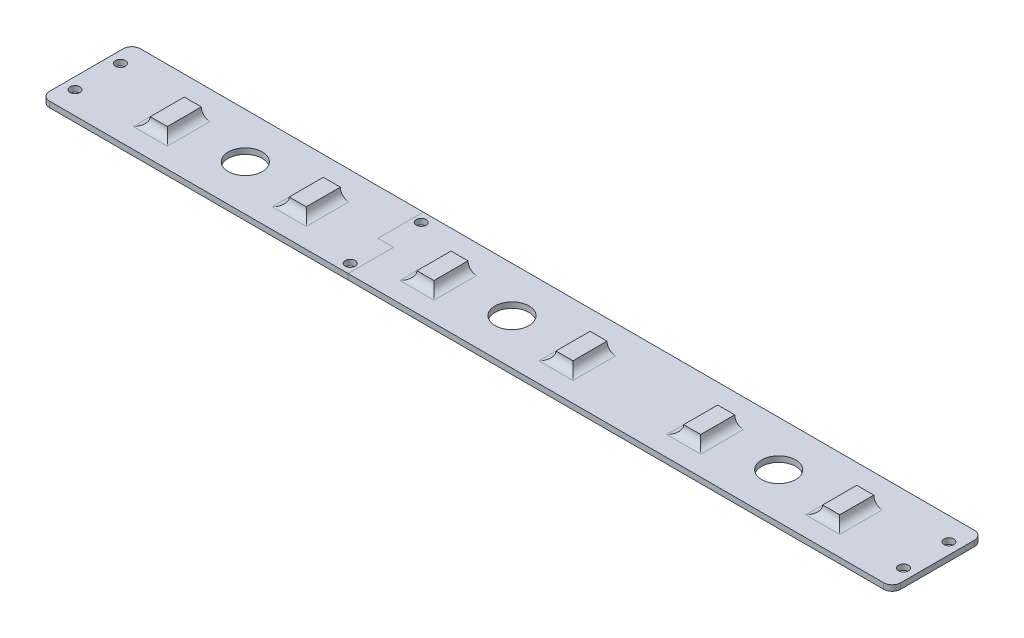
ISO-10303-21;
HEADER;
FILE_DESCRIPTION(('STEP AP214'),'2;1');
FILE_NAME('part.step','',(''),(''),'','','');
FILE_SCHEMA(('AUTOMOTIVE_DESIGN { 1 0 10303 214 1 1 1 1 }'));
ENDSEC;
DATA;
#1=APPLICATION_CONTEXT('core data for automotive mechanical design processes');
#2=APPLICATION_PROTOCOL_DEFINITION('international standard','automotive_design',2000,#1);
#3=PRODUCT_CONTEXT('',#1,'mechanical');
#4=PRODUCT('Part','Part','',(#3));
#5=PRODUCT_RELATED_PRODUCT_CATEGORY('part','',(#4));
#6=PRODUCT_DEFINITION_FORMATION('','',#4);
#7=PRODUCT_DEFINITION_CONTEXT('part definition',#1,'design');
#8=PRODUCT_DEFINITION('design','',#6,#7);
#9=PRODUCT_DEFINITION_SHAPE('','',#8);
#10=(LENGTH_UNIT() NAMED_UNIT(*) SI_UNIT(.MILLI.,.METRE.));
#11=(NAMED_UNIT(*) PLANE_ANGLE_UNIT() SI_UNIT($,.RADIAN.));
#12=(NAMED_UNIT(*) SI_UNIT($,.STERADIAN.) SOLID_ANGLE_UNIT());
#13=UNCERTAINTY_MEASURE_WITH_UNIT(LENGTH_MEASURE(1.E-05),#10,'distance_accuracy_value','');
#14=(GEOMETRIC_REPRESENTATION_CONTEXT(3) GLOBAL_UNCERTAINTY_ASSIGNED_CONTEXT((#13)) GLOBAL_UNIT_ASSIGNED_CONTEXT((#10,
#11,#12)) REPRESENTATION_CONTEXT('',''));
#15=CARTESIAN_POINT('',(0.,0.,0.));
#16=DIRECTION('',(0.,0.,1.));
#17=DIRECTION('',(1.,0.,0.));
#18=AXIS2_PLACEMENT_3D('',#15,#16,#17);
#19=CARTESIAN_POINT('',(-47.25,-2.01,-16.));
#20=DIRECTION('',(-1.,0.,0.));
#21=DIRECTION('',(0.,0.,1.));
#22=AXIS2_PLACEMENT_3D('',#19,#20,#21);
#23=PLANE('',#22);
#24=DIRECTION('',(0.,1.,0.));
#25=VECTOR('',#24,1.);
#26=CARTESIAN_POINT('',(-47.25,-2.01,0.));
#27=LINE('',#26,#25);
#28=CARTESIAN_POINT('',(-47.25,-2.,0.));
#29=VERTEX_POINT('',#28);
#30=CARTESIAN_POINT('',(-47.25,0.,0.));
#31=VERTEX_POINT('',#30);
#32=EDGE_CURVE('E12',#29,#31,#27,.T.);
#33=ORIENTED_EDGE('',*,*,#32,.T.);
#34=DIRECTION('',(0.,0.,-1.));
#35=VECTOR('',#34,1.);
#36=CARTESIAN_POINT('',(-47.25,0.,0.));
#37=LINE('',#36,#35);
#38=CARTESIAN_POINT('',(-47.25,0.,-16.));
#39=VERTEX_POINT('',#38);
#40=EDGE_CURVE('E159',#31,#39,#37,.T.);
#41=ORIENTED_EDGE('',*,*,#40,.T.);
#42=DIRECTION('',(0.,-1.,0.));
#43=VECTOR('',#42,1.);
#44=CARTESIAN_POINT('',(-47.25,-2.,-16.));
#45=LINE('',#44,#43);
#46=CARTESIAN_POINT('',(-47.25,-2.,-16.));
#47=VERTEX_POINT('',#46);
#48=EDGE_CURVE('E165',#39,#47,#45,.T.);
#49=ORIENTED_EDGE('',*,*,#48,.T.);
#50=DIRECTION('',(0.,0.,-1.));
#51=VECTOR('',#50,1.);
#52=CARTESIAN_POINT('',(-47.25,-2.,0.));
#53=LINE('',#52,#51);
#54=EDGE_CURVE('E143',#29,#47,#53,.T.);
#55=ORIENTED_EDGE('',*,*,#54,.F.);
#56=EDGE_LOOP('',(#33,#41,#49,#55));
#57=FACE_BOUND('',#56,.T.);
#58=ADVANCED_FACE('F47',(#57),#23,.T.);
#59=CARTESIAN_POINT('',(-47.25,-2.01,0.));
#60=DIRECTION('',(0.,0.,1.));
#61=DIRECTION('',(1.,0.,0.));
#62=AXIS2_PLACEMENT_3D('',#59,#60,#61);
#63=PLANE('',#62);
#64=DIRECTION('',(0.,1.,0.));
#65=VECTOR('',#64,1.);
#66=CARTESIAN_POINT('',(-41.75,-2.01,0.));
#67=LINE('',#66,#65);
#68=CARTESIAN_POINT('',(-41.75,-2.,0.));
#69=VERTEX_POINT('',#68);
#70=CARTESIAN_POINT('',(-41.75,0.,0.));
#71=VERTEX_POINT('',#70);
#72=EDGE_CURVE('E57',#69,#71,#67,.T.);
#73=ORIENTED_EDGE('',*,*,#72,.T.);
#74=DIRECTION('',(-1.,0.,0.));
#75=VECTOR('',#74,1.);
#76=CARTESIAN_POINT('',(0.,0.,0.));
#77=LINE('',#76,#75);
#78=EDGE_CURVE('E156',#71,#31,#77,.T.);
#79=ORIENTED_EDGE('',*,*,#78,.T.);
#80=ORIENTED_EDGE('',*,*,#32,.F.);
#81=DIRECTION('',(-1.,0.,0.));
#82=VECTOR('',#81,1.);
#83=CARTESIAN_POINT('',(0.,-2.,0.));
#84=LINE('',#83,#82);
#85=EDGE_CURVE('E147',#69,#29,#84,.T.);
#86=ORIENTED_EDGE('',*,*,#85,.F.);
#87=EDGE_LOOP('',(#73,#79,#80,#86));
#88=FACE_BOUND('',#87,.T.);
#89=ADVANCED_FACE('F531',(#88),#63,.T.);
#90=CARTESIAN_POINT('',(-41.75,-2.01,0.));
#91=DIRECTION('',(-1.,0.,0.));
#92=DIRECTION('',(0.,0.,1.));
#93=AXIS2_PLACEMENT_3D('',#90,#91,#92);
#94=PLANE('',#93);
#95=DIRECTION('',(0.,1.,0.));
#96=VECTOR('',#95,1.);
#97=CARTESIAN_POINT('',(-41.75,-2.,16.));
#98=LINE('',#97,#96);
#99=CARTESIAN_POINT('',(-41.75,-2.,16.));
#100=VERTEX_POINT('',#99);
#101=CARTESIAN_POINT('',(-41.75,0.,16.));
#102=VERTEX_POINT('',#101);
#103=EDGE_CURVE('E162',#100,#102,#98,.T.);
#104=ORIENTED_EDGE('',*,*,#103,.T.);
#105=DIRECTION('',(0.,0.,-1.));
#106=VECTOR('',#105,1.);
#107=CARTESIAN_POINT('',(-41.75,0.,0.));
#108=LINE('',#107,#106);
#109=EDGE_CURVE('E153',#102,#71,#108,.T.);
#110=ORIENTED_EDGE('',*,*,#109,.T.);
#111=ORIENTED_EDGE('',*,*,#72,.F.);
#112=DIRECTION('',(0.,0.,-1.));
#113=VECTOR('',#112,1.);
#114=CARTESIAN_POINT('',(-41.75,-2.,0.));
#115=LINE('',#114,#113);
#116=EDGE_CURVE('E150',#100,#69,#115,.T.);
#117=ORIENTED_EDGE('',*,*,#116,.F.);
#118=EDGE_LOOP('',(#104,#110,#111,#117));
#119=FACE_BOUND('',#118,.T.);
#120=ADVANCED_FACE('F523',(#119),#94,.T.);
#121=CARTESIAN_POINT('',(93.9999999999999,0.,4.));
#122=DIRECTION('',(0.,0.,-1.));
#123=DIRECTION('',(1.,0.,0.));
#124=AXIS2_PLACEMENT_3D('',#121,#122,#123);
#125=PLANE('',#124);
#126=DIRECTION('',(0.,-1.,0.));
#127=VECTOR('',#126,1.);
#128=CARTESIAN_POINT('',(116.25,2.25,4.));
#129=LINE('',#128,#127);
#130=CARTESIAN_POINT('',(116.25,2.25,4.));
#131=VERTEX_POINT('',#130);
#132=CARTESIAN_POINT('',(116.25,0.75,4.));
#133=VERTEX_POINT('',#132);
#134=EDGE_CURVE('E120',#131,#133,#129,.T.);
#135=ORIENTED_EDGE('',*,*,#134,.F.);
#136=DIRECTION('',(-1.,0.,0.));
#137=VECTOR('',#136,1.);
#138=CARTESIAN_POINT('',(120.75,2.25,4.));
#139=LINE('',#138,#137);
#140=CARTESIAN_POINT('',(120.75,2.25,4.));
#141=VERTEX_POINT('',#140);
#142=EDGE_CURVE('E110',#141,#131,#139,.T.);
#143=ORIENTED_EDGE('',*,*,#142,.F.);
#144=DIRECTION('',(0.,1.,0.));
#145=VECTOR('',#144,1.);
#146=CARTESIAN_POINT('',(120.75,0.75,4.));
#147=LINE('',#146,#145);
#148=CARTESIAN_POINT('',(120.75,0.75,4.));
#149=VERTEX_POINT('',#148);
#150=EDGE_CURVE('E104',#149,#141,#147,.T.);
#151=ORIENTED_EDGE('',*,*,#150,.F.);
#152=DIRECTION('',(1.,0.,0.));
#153=VECTOR('',#152,1.);
#154=CARTESIAN_POINT('',(116.25,0.75,4.));
#155=LINE('',#154,#153);
#156=EDGE_CURVE('E130',#133,#149,#155,.T.);
#157=ORIENTED_EDGE('',*,*,#156,.F.);
#158=EDGE_LOOP('',(#135,#143,#151,#157));
#159=FACE_BOUND('',#158,.T.);
#160=ADVANCED_FACE('F132',(#159),#125,.T.);
#161=CARTESIAN_POINT('',(93.9999999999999,0.,4.));
#162=DIRECTION('',(0.,0.,-1.));
#163=DIRECTION('',(1.,0.,0.));
#164=AXIS2_PLACEMENT_3D('',#161,#162,#163);
#165=PLANE('',#164);
#166=DIRECTION('',(0.,-1.,0.));
#167=VECTOR('',#166,1.);
#168=CARTESIAN_POINT('',(67.2499999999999,2.25,4.));
#169=LINE('',#168,#167);
#170=CARTESIAN_POINT('',(67.2499999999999,2.25,4.));
#171=VERTEX_POINT('',#170);
#172=CARTESIAN_POINT('',(67.2499999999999,0.75,4.));
#173=VERTEX_POINT('',#172);
#174=EDGE_CURVE('E324',#171,#173,#169,.T.);
#175=ORIENTED_EDGE('',*,*,#174,.F.);
#176=DIRECTION('',(-1.,0.,0.));
#177=VECTOR('',#176,1.);
#178=CARTESIAN_POINT('',(71.75,2.25,4.));
#179=LINE('',#178,#177);
#180=CARTESIAN_POINT('',(71.75,2.25,4.));
#181=VERTEX_POINT('',#180);
#182=EDGE_CURVE('E337',#181,#171,#179,.T.);
#183=ORIENTED_EDGE('',*,*,#182,.F.);
#184=DIRECTION('',(0.,1.,0.));
#185=VECTOR('',#184,1.);
#186=CARTESIAN_POINT('',(71.75,0.75,4.));
#187=LINE('',#186,#185);
#188=CARTESIAN_POINT('',(71.75,0.75,4.));
#189=VERTEX_POINT('',#188);
#190=EDGE_CURVE('E335',#189,#181,#187,.T.);
#191=ORIENTED_EDGE('',*,*,#190,.F.);
#192=DIRECTION('',(1.,0.,0.));
#193=VECTOR('',#192,1.);
#194=CARTESIAN_POINT('',(67.2499999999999,0.75,4.));
#195=LINE('',#194,#193);
#196=EDGE_CURVE('E313',#173,#189,#195,.T.);
#197=ORIENTED_EDGE('',*,*,#196,.F.);
#198=EDGE_LOOP('',(#175,#183,#191,#197));
#199=FACE_BOUND('',#198,.T.);
#200=ADVANCED_FACE('F508',(#199),#165,.T.);
#201=CARTESIAN_POINT('',(0.,0.,4.));
#202=DIRECTION('',(0.,0.,-1.));
#203=DIRECTION('',(-1.,0.,0.));
#204=AXIS2_PLACEMENT_3D('',#201,#202,#203);
#205=PLANE('',#204);
#206=DIRECTION('',(0.,-1.,0.));
#207=VECTOR('',#206,1.);
#208=CARTESIAN_POINT('',(26.75,2.25,4.));
#209=LINE('',#208,#207);
#210=CARTESIAN_POINT('',(26.75,2.25,4.));
#211=VERTEX_POINT('',#210);
#212=CARTESIAN_POINT('',(26.75,0.75,4.));
#213=VERTEX_POINT('',#212);
#214=EDGE_CURVE('E703',#211,#213,#209,.T.);
#215=ORIENTED_EDGE('',*,*,#214,.T.);
#216=DIRECTION('',(-1.,0.,0.));
#217=VECTOR('',#216,1.);
#218=CARTESIAN_POINT('',(26.75,0.75,4.));
#219=LINE('',#218,#217);
#220=CARTESIAN_POINT('',(22.25,0.75,4.));
#221=VERTEX_POINT('',#220);
#222=EDGE_CURVE('E706',#213,#221,#219,.T.);
#223=ORIENTED_EDGE('',*,*,#222,.T.);
#224=DIRECTION('',(0.,1.,0.));
#225=VECTOR('',#224,1.);
#226=CARTESIAN_POINT('',(22.25,0.75,4.));
#227=LINE('',#226,#225);
#228=CARTESIAN_POINT('',(22.25,2.25,4.));
#229=VERTEX_POINT('',#228);
#230=EDGE_CURVE('E710',#221,#229,#227,.T.);
#231=ORIENTED_EDGE('',*,*,#230,.T.);
#232=DIRECTION('',(1.,0.,0.));
#233=VECTOR('',#232,1.);
#234=CARTESIAN_POINT('',(22.25,2.25,4.));
#235=LINE('',#234,#233);
#236=EDGE_CURVE('E713',#229,#211,#235,.T.);
#237=ORIENTED_EDGE('',*,*,#236,.T.);
#238=EDGE_LOOP('',(#215,#223,#231,#237));
#239=FACE_BOUND('',#238,.T.);
#240=ADVANCED_FACE('F529',(#239),#205,.T.);
#241=CARTESIAN_POINT('',(0.,0.,4.));
#242=DIRECTION('',(0.,0.,-1.));
#243=DIRECTION('',(-1.,0.,0.));
#244=AXIS2_PLACEMENT_3D('',#241,#242,#243);
#245=PLANE('',#244);
#246=DIRECTION('',(0.,-1.,0.));
#247=VECTOR('',#246,1.);
#248=CARTESIAN_POINT('',(-22.25,2.25,4.));
#249=LINE('',#248,#247);
#250=CARTESIAN_POINT('',(-22.25,2.25,4.));
#251=VERTEX_POINT('',#250);
#252=CARTESIAN_POINT('',(-22.25,0.75,4.));
#253=VERTEX_POINT('',#252);
#254=EDGE_CURVE('E228',#251,#253,#249,.T.);
#255=ORIENTED_EDGE('',*,*,#254,.T.);
#256=DIRECTION('',(-1.,0.,0.));
#257=VECTOR('',#256,1.);
#258=CARTESIAN_POINT('',(-22.25,0.75,4.));
#259=LINE('',#258,#257);
#260=CARTESIAN_POINT('',(-26.75,0.75,4.));
#261=VERTEX_POINT('',#260);
#262=EDGE_CURVE('E243',#253,#261,#259,.T.);
#263=ORIENTED_EDGE('',*,*,#262,.T.);
#264=DIRECTION('',(0.,1.,0.));
#265=VECTOR('',#264,1.);
#266=CARTESIAN_POINT('',(-26.75,0.75,4.));
#267=LINE('',#266,#265);
#268=CARTESIAN_POINT('',(-26.75,2.25,4.));
#269=VERTEX_POINT('',#268);
#270=EDGE_CURVE('E240',#261,#269,#267,.T.);
#271=ORIENTED_EDGE('',*,*,#270,.T.);
#272=DIRECTION('',(1.,0.,0.));
#273=VECTOR('',#272,1.);
#274=CARTESIAN_POINT('',(-26.75,2.25,4.));
#275=LINE('',#274,#273);
#276=EDGE_CURVE('E215',#269,#251,#275,.T.);
#277=ORIENTED_EDGE('',*,*,#276,.T.);
#278=EDGE_LOOP('',(#255,#263,#271,#277));
#279=FACE_BOUND('',#278,.T.);
#280=ADVANCED_FACE('F795',(#279),#245,.T.);
#281=CARTESIAN_POINT('',(120.75,0.75,4.));
#282=DIRECTION('',(-1.,0.,0.));
#283=DIRECTION('',(0.,0.,1.));
#284=AXIS2_PLACEMENT_3D('',#281,#282,#283);
#285=PLANE('',#284);
#286=DIRECTION('',(0.,1.,0.));
#287=VECTOR('',#286,1.);
#288=CARTESIAN_POINT('',(120.75,0.75,-6.));
#289=LINE('',#288,#287);
#290=CARTESIAN_POINT('',(120.75,0.75,-6.));
#291=VERTEX_POINT('',#290);
#292=CARTESIAN_POINT('',(120.75,2.25,-6.));
#293=VERTEX_POINT('',#292);
#294=EDGE_CURVE('E136',#291,#293,#289,.T.);
#295=ORIENTED_EDGE('',*,*,#294,.F.);
#296=DIRECTION('',(0.,0.,-1.));
#297=VECTOR('',#296,1.);
#298=CARTESIAN_POINT('',(120.75,0.75,4.));
#299=LINE('',#298,#297);
#300=EDGE_CURVE('E342',#149,#291,#299,.T.);
#301=ORIENTED_EDGE('',*,*,#300,.F.);
#302=ORIENTED_EDGE('',*,*,#150,.T.);
#303=DIRECTION('',(0.,0.,-1.));
#304=VECTOR('',#303,1.);
#305=CARTESIAN_POINT('',(120.75,2.25,4.));
#306=LINE('',#305,#304);
#307=EDGE_CURVE('E117',#141,#293,#306,.T.);
#308=ORIENTED_EDGE('',*,*,#307,.T.);
#309=EDGE_LOOP('',(#295,#301,#302,#308));
#310=FACE_BOUND('',#309,.T.);
#311=ADVANCED_FACE('F353',(#310),#285,.T.);
#312=CARTESIAN_POINT('',(116.25,0.75,4.));
#313=DIRECTION('',(0.,1.,0.));
#314=DIRECTION('',(0.,0.,1.));
#315=AXIS2_PLACEMENT_3D('',#312,#313,#314);
#316=PLANE('',#315);
#317=DIRECTION('',(1.,0.,0.));
#318=VECTOR('',#317,1.);
#319=CARTESIAN_POINT('',(116.25,0.75,-6.));
#320=LINE('',#319,#318);
#321=CARTESIAN_POINT('',(116.25,0.75,-6.));
#322=VERTEX_POINT('',#321);
#323=EDGE_CURVE('E133',#322,#291,#320,.T.);
#324=ORIENTED_EDGE('',*,*,#323,.F.);
#325=DIRECTION('',(0.,0.,-1.));
#326=VECTOR('',#325,1.);
#327=CARTESIAN_POINT('',(116.25,0.75,4.));
#328=LINE('',#327,#326);
#329=EDGE_CURVE('E298',#133,#322,#328,.T.);
#330=ORIENTED_EDGE('',*,*,#329,.F.);
#331=ORIENTED_EDGE('',*,*,#156,.T.);
#332=ORIENTED_EDGE('',*,*,#300,.T.);
#333=EDGE_LOOP('',(#324,#330,#331,#332));
#334=FACE_BOUND('',#333,.T.);
#335=ADVANCED_FACE('F351',(#334),#316,.T.);
#336=CARTESIAN_POINT('',(116.25,2.25,4.));
#337=DIRECTION('',(1.,0.,0.));
#338=DIRECTION('',(0.,0.,-1.));
#339=AXIS2_PLACEMENT_3D('',#336,#337,#338);
#340=PLANE('',#339);
#341=DIRECTION('',(0.,-1.,0.));
#342=VECTOR('',#341,1.);
#343=CARTESIAN_POINT('',(116.25,2.25,-6.));
#344=LINE('',#343,#342);
#345=CARTESIAN_POINT('',(116.25,2.25,-6.));
#346=VERTEX_POINT('',#345);
#347=EDGE_CURVE('E129',#346,#322,#344,.T.);
#348=ORIENTED_EDGE('',*,*,#347,.F.);
#349=DIRECTION('',(0.,0.,-1.));
#350=VECTOR('',#349,1.);
#351=CARTESIAN_POINT('',(116.25,2.25,4.));
#352=LINE('',#351,#350);
#353=EDGE_CURVE('E115',#131,#346,#352,.T.);
#354=ORIENTED_EDGE('',*,*,#353,.F.);
#355=ORIENTED_EDGE('',*,*,#134,.T.);
#356=ORIENTED_EDGE('',*,*,#329,.T.);
#357=EDGE_LOOP('',(#348,#354,#355,#356));
#358=FACE_BOUND('',#357,.T.);
#359=ADVANCED_FACE('F125',(#358),#340,.T.);
#360=CARTESIAN_POINT('',(120.75,2.25,4.));
#361=DIRECTION('',(0.,-1.,0.));
#362=DIRECTION('',(0.,0.,-1.));
#363=AXIS2_PLACEMENT_3D('',#360,#361,#362);
#364=PLANE('',#363);
#365=DIRECTION('',(-1.,0.,0.));
#366=VECTOR('',#365,1.);
#367=CARTESIAN_POINT('',(120.75,2.25,-6.));
#368=LINE('',#367,#366);
#369=EDGE_CURVE('E347',#293,#346,#368,.T.);
#370=ORIENTED_EDGE('',*,*,#369,.F.);
#371=ORIENTED_EDGE('',*,*,#307,.F.);
#372=ORIENTED_EDGE('',*,*,#142,.T.);
#373=ORIENTED_EDGE('',*,*,#353,.T.);
#374=EDGE_LOOP('',(#370,#371,#372,#373));
#375=FACE_BOUND('',#374,.T.);
#376=ADVANCED_FACE('F113',(#375),#364,.T.);
#377=CARTESIAN_POINT('',(93.9999999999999,3.,0.));
#378=DIRECTION('',(0.,1.,0.));
#379=DIRECTION('',(0.,0.,1.));
#380=AXIS2_PLACEMENT_3D('',#377,#378,#379);
#381=PLANE('',#380);
#382=DIRECTION('',(0.,0.,-1.));
#383=VECTOR('',#382,1.);
#384=CARTESIAN_POINT('',(115.5,3.,-6.));
#385=LINE('',#384,#383);
#386=CARTESIAN_POINT('',(115.5,3.,6.));
#387=VERTEX_POINT('',#386);
#388=CARTESIAN_POINT('',(115.5,3.,-6.));
#389=VERTEX_POINT('',#388);
#390=EDGE_CURVE('E299',#387,#389,#385,.T.);
#391=ORIENTED_EDGE('',*,*,#390,.F.);
#392=DIRECTION('',(-1.,0.,0.));
#393=VECTOR('',#392,1.);
#394=CARTESIAN_POINT('',(121.5,3.,6.));
#395=LINE('',#394,#393);
#396=CARTESIAN_POINT('',(121.5,3.,6.));
#397=VERTEX_POINT('',#396);
#398=EDGE_CURVE('E305',#397,#387,#395,.T.);
#399=ORIENTED_EDGE('',*,*,#398,.F.);
#400=DIRECTION('',(0.,0.,1.));
#401=VECTOR('',#400,1.);
#402=CARTESIAN_POINT('',(121.5,3.,-6.));
#403=LINE('',#402,#401);
#404=CARTESIAN_POINT('',(121.5,3.,-6.));
#405=VERTEX_POINT('',#404);
#406=EDGE_CURVE('E302',#405,#397,#403,.T.);
#407=ORIENTED_EDGE('',*,*,#406,.F.);
#408=DIRECTION('',(1.,0.,0.));
#409=VECTOR('',#408,1.);
#410=CARTESIAN_POINT('',(121.5,3.,-6.));
#411=LINE('',#410,#409);
#412=EDGE_CURVE('E283',#389,#405,#411,.T.);
#413=ORIENTED_EDGE('',*,*,#412,.F.);
#414=EDGE_LOOP('',(#391,#399,#407,#413));
#415=FACE_BOUND('',#414,.T.);
#416=ADVANCED_FACE('F512',(#415),#381,.T.);
#417=CARTESIAN_POINT('',(71.75,0.75,4.));
#418=DIRECTION('',(-1.,0.,0.));
#419=DIRECTION('',(0.,0.,1.));
#420=AXIS2_PLACEMENT_3D('',#417,#418,#419);
#421=PLANE('',#420);
#422=DIRECTION('',(0.,1.,0.));
#423=VECTOR('',#422,1.);
#424=CARTESIAN_POINT('',(71.75,0.75,-6.));
#425=LINE('',#424,#423);
#426=CARTESIAN_POINT('',(71.75,0.75,-6.));
#427=VERTEX_POINT('',#426);
#428=CARTESIAN_POINT('',(71.75,2.25,-6.));
#429=VERTEX_POINT('',#428);
#430=EDGE_CURVE('E323',#427,#429,#425,.T.);
#431=ORIENTED_EDGE('',*,*,#430,.F.);
#432=DIRECTION('',(0.,0.,-1.));
#433=VECTOR('',#432,1.);
#434=CARTESIAN_POINT('',(71.75,0.75,4.));
#435=LINE('',#434,#433);
#436=EDGE_CURVE('E315',#189,#427,#435,.T.);
#437=ORIENTED_EDGE('',*,*,#436,.F.);
#438=ORIENTED_EDGE('',*,*,#190,.T.);
#439=DIRECTION('',(0.,0.,-1.));
#440=VECTOR('',#439,1.);
#441=CARTESIAN_POINT('',(71.75,2.25,4.));
#442=LINE('',#441,#440);
#443=EDGE_CURVE('E66',#181,#429,#442,.T.);
#444=ORIENTED_EDGE('',*,*,#443,.T.);
#445=EDGE_LOOP('',(#431,#437,#438,#444));
#446=FACE_BOUND('',#445,.T.);
#447=ADVANCED_FACE('F510',(#446),#421,.T.);
#448=CARTESIAN_POINT('',(67.2499999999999,0.75,4.));
#449=DIRECTION('',(0.,1.,0.));
#450=DIRECTION('',(0.,0.,1.));
#451=AXIS2_PLACEMENT_3D('',#448,#449,#450);
#452=PLANE('',#451);
#453=DIRECTION('',(1.,0.,0.));
#454=VECTOR('',#453,1.);
#455=CARTESIAN_POINT('',(67.2499999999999,0.75,-6.));
#456=LINE('',#455,#454);
#457=CARTESIAN_POINT('',(67.2499999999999,0.75,-6.));
#458=VERTEX_POINT('',#457);
#459=EDGE_CURVE('E320',#458,#427,#456,.T.);
#460=ORIENTED_EDGE('',*,*,#459,.F.);
#461=DIRECTION('',(0.,0.,-1.));
#462=VECTOR('',#461,1.);
#463=CARTESIAN_POINT('',(67.2499999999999,0.75,4.));
#464=LINE('',#463,#462);
#465=EDGE_CURVE('E317',#173,#458,#464,.T.);
#466=ORIENTED_EDGE('',*,*,#465,.F.);
#467=ORIENTED_EDGE('',*,*,#196,.T.);
#468=ORIENTED_EDGE('',*,*,#436,.T.);
#469=EDGE_LOOP('',(#460,#466,#467,#468));
#470=FACE_BOUND('',#469,.T.);
#471=ADVANCED_FACE('F496',(#470),#452,.T.);
#472=CARTESIAN_POINT('',(67.2499999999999,2.25,4.));
#473=DIRECTION('',(1.,0.,0.));
#474=DIRECTION('',(0.,0.,-1.));
#475=AXIS2_PLACEMENT_3D('',#472,#473,#474);
#476=PLANE('',#475);
#477=DIRECTION('',(0.,-1.,0.));
#478=VECTOR('',#477,1.);
#479=CARTESIAN_POINT('',(67.2499999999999,2.25,-6.));
#480=LINE('',#479,#478);
#481=CARTESIAN_POINT('',(67.2499999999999,2.25,-5.99999999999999));
#482=VERTEX_POINT('',#481);
#483=EDGE_CURVE('E330',#482,#458,#480,.T.);
#484=ORIENTED_EDGE('',*,*,#483,.F.);
#485=DIRECTION('',(0.,0.,-1.));
#486=VECTOR('',#485,1.);
#487=CARTESIAN_POINT('',(67.2499999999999,2.25,4.));
#488=LINE('',#487,#486);
#489=EDGE_CURVE('E310',#171,#482,#488,.T.);
#490=ORIENTED_EDGE('',*,*,#489,.F.);
#491=ORIENTED_EDGE('',*,*,#174,.T.);
#492=ORIENTED_EDGE('',*,*,#465,.T.);
#493=EDGE_LOOP('',(#484,#490,#491,#492));
#494=FACE_BOUND('',#493,.T.);
#495=ADVANCED_FACE('F500',(#494),#476,.T.);
#496=CARTESIAN_POINT('',(71.75,2.25,4.));
#497=DIRECTION('',(0.,-1.,0.));
#498=DIRECTION('',(0.,0.,-1.));
#499=AXIS2_PLACEMENT_3D('',#496,#497,#498);
#500=PLANE('',#499);
#501=DIRECTION('',(-1.,0.,0.));
#502=VECTOR('',#501,1.);
#503=CARTESIAN_POINT('',(71.75,2.25,-6.));
#504=LINE('',#503,#502);
#505=EDGE_CURVE('E327',#429,#482,#504,.T.);
#506=ORIENTED_EDGE('',*,*,#505,.F.);
#507=ORIENTED_EDGE('',*,*,#443,.F.);
#508=ORIENTED_EDGE('',*,*,#182,.T.);
#509=ORIENTED_EDGE('',*,*,#489,.T.);
#510=EDGE_LOOP('',(#506,#507,#508,#509));
#511=FACE_BOUND('',#510,.T.);
#512=ADVANCED_FACE('F505',(#511),#500,.T.);
#513=CARTESIAN_POINT('',(93.9999999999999,3.,0.));
#514=DIRECTION('',(0.,1.,0.));
#515=DIRECTION('',(0.,0.,1.));
#516=AXIS2_PLACEMENT_3D('',#513,#514,#515);
#517=PLANE('',#516);
#518=DIRECTION('',(0.,0.,-1.));
#519=VECTOR('',#518,1.);
#520=CARTESIAN_POINT('',(66.4999999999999,3.,-5.99999999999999));
#521=LINE('',#520,#519);
#522=CARTESIAN_POINT('',(66.4999999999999,3.,6.00000000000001));
#523=VERTEX_POINT('',#522);
#524=CARTESIAN_POINT('',(66.4999999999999,3.,-5.99999999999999));
#525=VERTEX_POINT('',#524);
#526=EDGE_CURVE('E284',#523,#525,#521,.T.);
#527=ORIENTED_EDGE('',*,*,#526,.F.);
#528=DIRECTION('',(-1.,0.,0.));
#529=VECTOR('',#528,1.);
#530=CARTESIAN_POINT('',(72.5,3.,6.00000000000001));
#531=LINE('',#530,#529);
#532=CARTESIAN_POINT('',(72.5,3.,6.00000000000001));
#533=VERTEX_POINT('',#532);
#534=EDGE_CURVE('E290',#533,#523,#531,.T.);
#535=ORIENTED_EDGE('',*,*,#534,.F.);
#536=DIRECTION('',(0.,0.,1.));
#537=VECTOR('',#536,1.);
#538=CARTESIAN_POINT('',(72.5,3.,-5.99999999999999));
#539=LINE('',#538,#537);
#540=CARTESIAN_POINT('',(72.5,3.,-5.99999999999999));
#541=VERTEX_POINT('',#540);
#542=EDGE_CURVE('E287',#541,#533,#539,.T.);
#543=ORIENTED_EDGE('',*,*,#542,.F.);
#544=DIRECTION('',(1.,0.,0.));
#545=VECTOR('',#544,1.);
#546=CARTESIAN_POINT('',(72.5,3.,-5.99999999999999));
#547=LINE('',#546,#545);
#548=EDGE_CURVE('E279',#525,#541,#547,.T.);
#549=ORIENTED_EDGE('',*,*,#548,.F.);
#550=EDGE_LOOP('',(#527,#535,#543,#549));
#551=FACE_BOUND('',#550,.T.);
#552=ADVANCED_FACE('F758',(#551),#517,.T.);
#553=CARTESIAN_POINT('',(22.25,0.75,4.));
#554=DIRECTION('',(-1.,0.,0.));
#555=DIRECTION('',(0.,0.,1.));
#556=AXIS2_PLACEMENT_3D('',#553,#554,#555);
#557=PLANE('',#556);
#558=DIRECTION('',(0.,1.,0.));
#559=VECTOR('',#558,1.);
#560=CARTESIAN_POINT('',(22.25,0.75,-6.));
#561=LINE('',#560,#559);
#562=CARTESIAN_POINT('',(22.25,0.75,-6.));
#563=VERTEX_POINT('',#562);
#564=CARTESIAN_POINT('',(22.25,2.25,-6.));
#565=VERTEX_POINT('',#564);
#566=EDGE_CURVE('E721',#563,#565,#561,.T.);
#567=ORIENTED_EDGE('',*,*,#566,.T.);
#568=DIRECTION('',(0.,0.,-1.));
#569=VECTOR('',#568,1.);
#570=CARTESIAN_POINT('',(22.25,2.25,4.));
#571=LINE('',#570,#569);
#572=EDGE_CURVE('E727',#229,#565,#571,.T.);
#573=ORIENTED_EDGE('',*,*,#572,.F.);
#574=ORIENTED_EDGE('',*,*,#230,.F.);
#575=DIRECTION('',(0.,0.,-1.));
#576=VECTOR('',#575,1.);
#577=CARTESIAN_POINT('',(22.25,0.75,4.));
#578=LINE('',#577,#576);
#579=EDGE_CURVE('E729',#221,#563,#578,.T.);
#580=ORIENTED_EDGE('',*,*,#579,.T.);
#581=EDGE_LOOP('',(#567,#573,#574,#580));
#582=FACE_BOUND('',#581,.T.);
#583=ADVANCED_FACE('F744',(#582),#557,.F.);
#584=CARTESIAN_POINT('',(22.25,2.25,4.));
#585=DIRECTION('',(0.,1.,0.));
#586=DIRECTION('',(0.,0.,1.));
#587=AXIS2_PLACEMENT_3D('',#584,#585,#586);
#588=PLANE('',#587);
#589=DIRECTION('',(1.,0.,0.));
#590=VECTOR('',#589,1.);
#591=CARTESIAN_POINT('',(22.25,2.25,-6.));
#592=LINE('',#591,#590);
#593=CARTESIAN_POINT('',(26.75,2.25,-6.));
#594=VERTEX_POINT('',#593);
#595=EDGE_CURVE('E707',#565,#594,#592,.T.);
#596=ORIENTED_EDGE('',*,*,#595,.T.);
#597=DIRECTION('',(0.,0.,-1.));
#598=VECTOR('',#597,1.);
#599=CARTESIAN_POINT('',(26.75,2.25,4.));
#600=LINE('',#599,#598);
#601=EDGE_CURVE('E172',#211,#594,#600,.T.);
#602=ORIENTED_EDGE('',*,*,#601,.F.);
#603=ORIENTED_EDGE('',*,*,#236,.F.);
#604=ORIENTED_EDGE('',*,*,#572,.T.);
#605=EDGE_LOOP('',(#596,#602,#603,#604));
#606=FACE_BOUND('',#605,.T.);
#607=ADVANCED_FACE('F750',(#606),#588,.F.);
#608=CARTESIAN_POINT('',(26.75,2.25,4.));
#609=DIRECTION('',(1.,0.,0.));
#610=DIRECTION('',(0.,0.,-1.));
#611=AXIS2_PLACEMENT_3D('',#608,#609,#610);
#612=PLANE('',#611);
#613=DIRECTION('',(0.,-1.,0.));
#614=VECTOR('',#613,1.);
#615=CARTESIAN_POINT('',(26.75,2.25,-6.));
#616=LINE('',#615,#614);
#617=CARTESIAN_POINT('',(26.75,0.75,-5.99999999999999));
#618=VERTEX_POINT('',#617);
#619=EDGE_CURVE('E692',#594,#618,#616,.T.);
#620=ORIENTED_EDGE('',*,*,#619,.T.);
#621=DIRECTION('',(0.,0.,-1.));
#622=VECTOR('',#621,1.);
#623=CARTESIAN_POINT('',(26.75,0.75,4.));
#624=LINE('',#623,#622);
#625=EDGE_CURVE('E716',#213,#618,#624,.T.);
#626=ORIENTED_EDGE('',*,*,#625,.F.);
#627=ORIENTED_EDGE('',*,*,#214,.F.);
#628=ORIENTED_EDGE('',*,*,#601,.T.);
#629=EDGE_LOOP('',(#620,#626,#627,#628));
#630=FACE_BOUND('',#629,.T.);
#631=ADVANCED_FACE('F748',(#630),#612,.F.);
#632=CARTESIAN_POINT('',(26.75,0.75,4.));
#633=DIRECTION('',(0.,-1.,0.));
#634=DIRECTION('',(0.,0.,-1.));
#635=AXIS2_PLACEMENT_3D('',#632,#633,#634);
#636=PLANE('',#635);
#637=DIRECTION('',(-1.,0.,0.));
#638=VECTOR('',#637,1.);
#639=CARTESIAN_POINT('',(26.75,0.75,-6.));
#640=LINE('',#639,#638);
#641=EDGE_CURVE('E718',#618,#563,#640,.T.);
#642=ORIENTED_EDGE('',*,*,#641,.T.);
#643=ORIENTED_EDGE('',*,*,#579,.F.);
#644=ORIENTED_EDGE('',*,*,#222,.F.);
#645=ORIENTED_EDGE('',*,*,#625,.T.);
#646=EDGE_LOOP('',(#642,#643,#644,#645));
#647=FACE_BOUND('',#646,.T.);
#648=ADVANCED_FACE('F734',(#647),#636,.F.);
#649=CARTESIAN_POINT('',(0.,3.,0.));
#650=DIRECTION('',(0.,1.,0.));
#651=DIRECTION('',(0.,0.,1.));
#652=AXIS2_PLACEMENT_3D('',#649,#650,#651);
#653=PLANE('',#652);
#654=DIRECTION('',(0.,0.,-1.));
#655=VECTOR('',#654,1.);
#656=CARTESIAN_POINT('',(27.5,3.,-5.99999999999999));
#657=LINE('',#656,#655);
#658=CARTESIAN_POINT('',(27.5,3.,6.00000000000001));
#659=VERTEX_POINT('',#658);
#660=CARTESIAN_POINT('',(27.5,3.,-5.99999999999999));
#661=VERTEX_POINT('',#660);
#662=EDGE_CURVE('E693',#659,#661,#657,.T.);
#663=ORIENTED_EDGE('',*,*,#662,.T.);
#664=DIRECTION('',(-1.,0.,0.));
#665=VECTOR('',#664,1.);
#666=CARTESIAN_POINT('',(21.5,3.,-5.99999999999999));
#667=LINE('',#666,#665);
#668=CARTESIAN_POINT('',(21.5,3.,-5.99999999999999));
#669=VERTEX_POINT('',#668);
#670=EDGE_CURVE('E698',#661,#669,#667,.T.);
#671=ORIENTED_EDGE('',*,*,#670,.T.);
#672=DIRECTION('',(0.,0.,1.));
#673=VECTOR('',#672,1.);
#674=CARTESIAN_POINT('',(21.5,3.,-5.99999999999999));
#675=LINE('',#674,#673);
#676=CARTESIAN_POINT('',(21.5,3.,6.00000000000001));
#677=VERTEX_POINT('',#676);
#678=EDGE_CURVE('E696',#669,#677,#675,.T.);
#679=ORIENTED_EDGE('',*,*,#678,.T.);
#680=DIRECTION('',(1.,0.,0.));
#681=VECTOR('',#680,1.);
#682=CARTESIAN_POINT('',(21.5,3.,6.00000000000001));
#683=LINE('',#682,#681);
#684=EDGE_CURVE('E689',#677,#659,#683,.T.);
#685=ORIENTED_EDGE('',*,*,#684,.T.);
#686=EDGE_LOOP('',(#663,#671,#679,#685));
#687=FACE_BOUND('',#686,.T.);
#688=ADVANCED_FACE('F764',(#687),#653,.T.);
#689=CARTESIAN_POINT('',(-26.75,0.75,4.));
#690=DIRECTION('',(-1.,0.,0.));
#691=DIRECTION('',(0.,0.,1.));
#692=AXIS2_PLACEMENT_3D('',#689,#690,#691);
#693=PLANE('',#692);
#694=DIRECTION('',(0.,1.,0.));
#695=VECTOR('',#694,1.);
#696=CARTESIAN_POINT('',(-26.75,0.75,-6.));
#697=LINE('',#696,#695);
#698=CARTESIAN_POINT('',(-26.75,0.75,-6.));
#699=VERTEX_POINT('',#698);
#700=CARTESIAN_POINT('',(-26.75,2.25,-6.));
#701=VERTEX_POINT('',#700);
#702=EDGE_CURVE('E227',#699,#701,#697,.T.);
#703=ORIENTED_EDGE('',*,*,#702,.T.);
#704=DIRECTION('',(0.,0.,-1.));
#705=VECTOR('',#704,1.);
#706=CARTESIAN_POINT('',(-26.75,2.25,4.));
#707=LINE('',#706,#705);
#708=EDGE_CURVE('E219',#269,#701,#707,.T.);
#709=ORIENTED_EDGE('',*,*,#708,.F.);
#710=ORIENTED_EDGE('',*,*,#270,.F.);
#711=DIRECTION('',(0.,0.,-1.));
#712=VECTOR('',#711,1.);
#713=CARTESIAN_POINT('',(-26.75,0.75,4.));
#714=LINE('',#713,#712);
#715=EDGE_CURVE('E216',#261,#699,#714,.T.);
#716=ORIENTED_EDGE('',*,*,#715,.T.);
#717=EDGE_LOOP('',(#703,#709,#710,#716));
#718=FACE_BOUND('',#717,.T.);
#719=ADVANCED_FACE('F788',(#718),#693,.F.);
#720=CARTESIAN_POINT('',(-26.75,2.25,4.));
#721=DIRECTION('',(0.,1.,0.));
#722=DIRECTION('',(0.,0.,1.));
#723=AXIS2_PLACEMENT_3D('',#720,#721,#722);
#724=PLANE('',#723);
#725=DIRECTION('',(1.,0.,0.));
#726=VECTOR('',#725,1.);
#727=CARTESIAN_POINT('',(-26.75,2.25,-6.));
#728=LINE('',#727,#726);
#729=CARTESIAN_POINT('',(-22.25,2.25,-6.));
#730=VERTEX_POINT('',#729);
#731=EDGE_CURVE('E224',#701,#730,#728,.T.);
#732=ORIENTED_EDGE('',*,*,#731,.T.);
#733=DIRECTION('',(0.,0.,-1.));
#734=VECTOR('',#733,1.);
#735=CARTESIAN_POINT('',(-22.25,2.25,4.));
#736=LINE('',#735,#734);
#737=EDGE_CURVE('E209',#251,#730,#736,.T.);
#738=ORIENTED_EDGE('',*,*,#737,.F.);
#739=ORIENTED_EDGE('',*,*,#276,.F.);
#740=ORIENTED_EDGE('',*,*,#708,.T.);
#741=EDGE_LOOP('',(#732,#738,#739,#740));
#742=FACE_BOUND('',#741,.T.);
#743=ADVANCED_FACE('F783',(#742),#724,.F.);
#744=CARTESIAN_POINT('',(-22.25,2.25,4.));
#745=DIRECTION('',(1.,0.,0.));
#746=DIRECTION('',(0.,0.,-1.));
#747=AXIS2_PLACEMENT_3D('',#744,#745,#746);
#748=PLANE('',#747);
#749=DIRECTION('',(0.,-1.,0.));
#750=VECTOR('',#749,1.);
#751=CARTESIAN_POINT('',(-22.25,2.25,-6.));
#752=LINE('',#751,#750);
#753=CARTESIAN_POINT('',(-22.25,0.75,-6.));
#754=VERTEX_POINT('',#753);
#755=EDGE_CURVE('E234',#730,#754,#752,.T.);
#756=ORIENTED_EDGE('',*,*,#755,.T.);
#757=DIRECTION('',(0.,0.,-1.));
#758=VECTOR('',#757,1.);
#759=CARTESIAN_POINT('',(-22.25,0.75,4.));
#760=LINE('',#759,#758);
#761=EDGE_CURVE('E212',#253,#754,#760,.T.);
#762=ORIENTED_EDGE('',*,*,#761,.F.);
#763=ORIENTED_EDGE('',*,*,#254,.F.);
#764=ORIENTED_EDGE('',*,*,#737,.T.);
#765=EDGE_LOOP('',(#756,#762,#763,#764));
#766=FACE_BOUND('',#765,.T.);
#767=ADVANCED_FACE('F780',(#766),#748,.F.);
#768=CARTESIAN_POINT('',(-22.25,0.75,4.));
#769=DIRECTION('',(0.,-1.,0.));
#770=DIRECTION('',(0.,0.,-1.));
#771=AXIS2_PLACEMENT_3D('',#768,#769,#770);
#772=PLANE('',#771);
#773=DIRECTION('',(-1.,0.,0.));
#774=VECTOR('',#773,1.);
#775=CARTESIAN_POINT('',(-22.25,0.75,-6.));
#776=LINE('',#775,#774);
#777=EDGE_CURVE('E231',#754,#699,#776,.T.);
#778=ORIENTED_EDGE('',*,*,#777,.T.);
#779=ORIENTED_EDGE('',*,*,#715,.F.);
#780=ORIENTED_EDGE('',*,*,#262,.F.);
#781=ORIENTED_EDGE('',*,*,#761,.T.);
#782=EDGE_LOOP('',(#778,#779,#780,#781));
#783=FACE_BOUND('',#782,.T.);
#784=ADVANCED_FACE('F773',(#783),#772,.F.);
#785=CARTESIAN_POINT('',(0.,3.,0.));
#786=DIRECTION('',(0.,1.,0.));
#787=DIRECTION('',(0.,0.,1.));
#788=AXIS2_PLACEMENT_3D('',#785,#786,#787);
#789=PLANE('',#788);
#790=DIRECTION('',(0.,0.,-1.));
#791=VECTOR('',#790,1.);
#792=CARTESIAN_POINT('',(-21.5,3.,-6.));
#793=LINE('',#792,#791);
#794=CARTESIAN_POINT('',(-21.5,3.,6.));
#795=VERTEX_POINT('',#794);
#796=CARTESIAN_POINT('',(-21.5,3.,-6.));
#797=VERTEX_POINT('',#796);
#798=EDGE_CURVE('E196',#795,#797,#793,.T.);
#799=ORIENTED_EDGE('',*,*,#798,.T.);
#800=DIRECTION('',(-1.,0.,0.));
#801=VECTOR('',#800,1.);
#802=CARTESIAN_POINT('',(-27.5,3.,-6.));
#803=LINE('',#802,#801);
#804=CARTESIAN_POINT('',(-27.5,3.,-6.));
#805=VERTEX_POINT('',#804);
#806=EDGE_CURVE('E199',#797,#805,#803,.T.);
#807=ORIENTED_EDGE('',*,*,#806,.T.);
#808=DIRECTION('',(0.,0.,1.));
#809=VECTOR('',#808,1.);
#810=CARTESIAN_POINT('',(-27.5,3.,-6.));
#811=LINE('',#810,#809);
#812=CARTESIAN_POINT('',(-27.5,3.,6.));
#813=VERTEX_POINT('',#812);
#814=EDGE_CURVE('E203',#805,#813,#811,.T.);
#815=ORIENTED_EDGE('',*,*,#814,.T.);
#816=DIRECTION('',(1.,0.,0.));
#817=VECTOR('',#816,1.);
#818=CARTESIAN_POINT('',(-27.5,3.,6.));
#819=LINE('',#818,#817);
#820=EDGE_CURVE('E206',#813,#795,#819,.T.);
#821=ORIENTED_EDGE('',*,*,#820,.T.);
#822=EDGE_LOOP('',(#799,#807,#815,#821));
#823=FACE_BOUND('',#822,.T.);
#824=ADVANCED_FACE('F769',(#823),#789,.T.);
#825=CARTESIAN_POINT('',(112.5,3.,0.));
#826=DIRECTION('',(0.,0.,-1.));
#827=DIRECTION('',(-1.,0.,0.));
#828=AXIS2_PLACEMENT_3D('',#825,#826,#827);
#829=CYLINDRICAL_SURFACE('',#828,3.);
#830=CARTESIAN_POINT('',(112.5,3.,-6.));
#831=DIRECTION('',(0.,0.,-1.));
#832=DIRECTION('',(-1.,0.,0.));
#833=AXIS2_PLACEMENT_3D('',#830,#831,#832);
#834=CIRCLE('',#833,3.);
#835=CARTESIAN_POINT('',(112.5,0.,-6.));
#836=VERTEX_POINT('',#835);
#837=EDGE_CURVE('E619',#836,#389,#834,.F.);
#838=ORIENTED_EDGE('',*,*,#837,.F.);
#839=DIRECTION('',(0.,0.,-1.));
#840=VECTOR('',#839,1.);
#841=CARTESIAN_POINT('',(112.5,0.,0.));
#842=LINE('',#841,#840);
#843=CARTESIAN_POINT('',(112.5,0.,9.));
#844=VERTEX_POINT('',#843);
#845=EDGE_CURVE('E634',#844,#836,#842,.T.);
#846=ORIENTED_EDGE('',*,*,#845,.F.);
#847=CARTESIAN_POINT('',(112.5,3.,9.));
#848=DIRECTION('',(-0.707106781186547,0.,-0.707106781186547));
#849=DIRECTION('',(0.707106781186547,0.,-0.707106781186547));
#850=AXIS2_PLACEMENT_3D('',#847,#848,#849);
#851=ELLIPSE('',#850,4.24264068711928,3.);
#852=EDGE_CURVE('E142',#387,#844,#851,.T.);
#853=ORIENTED_EDGE('',*,*,#852,.F.);
#854=ORIENTED_EDGE('',*,*,#390,.T.);
#855=EDGE_LOOP('',(#838,#846,#853,#854));
#856=FACE_BOUND('',#855,.T.);
#857=ADVANCED_FACE('F772',(#856),#829,.F.);
#858=CARTESIAN_POINT('',(0.,3.,9.));
#859=DIRECTION('',(-1.,0.,0.));
#860=DIRECTION('',(0.,0.,1.));
#861=AXIS2_PLACEMENT_3D('',#858,#859,#860);
#862=CYLINDRICAL_SURFACE('',#861,3.);
#863=CARTESIAN_POINT('',(124.5,3.,9.));
#864=DIRECTION('',(-0.707106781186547,0.,0.707106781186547));
#865=DIRECTION('',(0.707106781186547,0.,0.707106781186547));
#866=AXIS2_PLACEMENT_3D('',#863,#864,#865);
#867=ELLIPSE('',#866,4.24264068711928,3.);
#868=CARTESIAN_POINT('',(124.5,0.,9.));
#869=VERTEX_POINT('',#868);
#870=EDGE_CURVE('E1369',#869,#397,#867,.F.);
#871=ORIENTED_EDGE('',*,*,#870,.T.);
#872=ORIENTED_EDGE('',*,*,#398,.T.);
#873=ORIENTED_EDGE('',*,*,#852,.T.);
#874=DIRECTION('',(-1.,0.,0.));
#875=VECTOR('',#874,1.);
#876=CARTESIAN_POINT('',(0.,0.,9.));
#877=LINE('',#876,#875);
#878=EDGE_CURVE('E631',#869,#844,#877,.T.);
#879=ORIENTED_EDGE('',*,*,#878,.F.);
#880=EDGE_LOOP('',(#871,#872,#873,#879));
#881=FACE_BOUND('',#880,.T.);
#882=ADVANCED_FACE('F912',(#881),#862,.F.);
#883=CARTESIAN_POINT('',(124.5,3.,0.));
#884=DIRECTION('',(0.,0.,1.));
#885=DIRECTION('',(1.,0.,0.));
#886=AXIS2_PLACEMENT_3D('',#883,#884,#885);
#887=CYLINDRICAL_SURFACE('',#886,3.);
#888=CARTESIAN_POINT('',(124.5,3.,-6.));
#889=DIRECTION('',(0.,0.,-1.));
#890=DIRECTION('',(-1.,0.,0.));
#891=AXIS2_PLACEMENT_3D('',#888,#889,#890);
#892=CIRCLE('',#891,3.);
#893=CARTESIAN_POINT('',(124.5,0.,-6.));
#894=VERTEX_POINT('',#893);
#895=EDGE_CURVE('E626',#405,#894,#892,.F.);
#896=ORIENTED_EDGE('',*,*,#895,.F.);
#897=ORIENTED_EDGE('',*,*,#406,.T.);
#898=ORIENTED_EDGE('',*,*,#870,.F.);
#899=DIRECTION('',(0.,0.,1.));
#900=VECTOR('',#899,1.);
#901=CARTESIAN_POINT('',(124.5,0.,0.));
#902=LINE('',#901,#900);
#903=EDGE_CURVE('E629',#894,#869,#902,.T.);
#904=ORIENTED_EDGE('',*,*,#903,.F.);
#905=EDGE_LOOP('',(#896,#897,#898,#904));
#906=FACE_BOUND('',#905,.T.);
#907=ADVANCED_FACE('F826',(#906),#887,.F.);
#908=CARTESIAN_POINT('',(121.5,3.,-6.));
#909=DIRECTION('',(0.,0.,-1.));
#910=DIRECTION('',(-1.,0.,0.));
#911=AXIS2_PLACEMENT_3D('',#908,#909,#910);
#912=PLANE('',#911);
#913=DIRECTION('',(1.,0.,0.));
#914=VECTOR('',#913,1.);
#915=CARTESIAN_POINT('',(121.5,0.,-6.));
#916=LINE('',#915,#914);
#917=EDGE_CURVE('E295',#836,#894,#916,.T.);
#918=ORIENTED_EDGE('',*,*,#917,.F.);
#919=ORIENTED_EDGE('',*,*,#837,.T.);
#920=ORIENTED_EDGE('',*,*,#412,.T.);
#921=ORIENTED_EDGE('',*,*,#895,.T.);
#922=EDGE_LOOP('',(#918,#919,#920,#921));
#923=FACE_BOUND('',#922,.T.);
#924=ORIENTED_EDGE('',*,*,#369,.T.);
#925=ORIENTED_EDGE('',*,*,#347,.T.);
#926=ORIENTED_EDGE('',*,*,#323,.T.);
#927=ORIENTED_EDGE('',*,*,#294,.T.);
#928=EDGE_LOOP('',(#924,#925,#926,#927));
#929=FACE_BOUND('',#928,.T.);
#930=ADVANCED_FACE('F355',(#923,#929),#912,.T.);
#931=CARTESIAN_POINT('',(63.4999999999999,3.,0.));
#932=DIRECTION('',(0.,0.,-1.));
#933=DIRECTION('',(-1.,0.,0.));
#934=AXIS2_PLACEMENT_3D('',#931,#932,#933);
#935=CYLINDRICAL_SURFACE('',#934,3.);
#936=CARTESIAN_POINT('',(63.4999999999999,3.,-5.99999999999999));
#937=DIRECTION('',(0.,0.,-1.));
#938=DIRECTION('',(-1.,0.,0.));
#939=AXIS2_PLACEMENT_3D('',#936,#937,#938);
#940=CIRCLE('',#939,3.);
#941=CARTESIAN_POINT('',(63.4999999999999,0.,-5.99999999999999));
#942=VERTEX_POINT('',#941);
#943=EDGE_CURVE('E146',#942,#525,#940,.F.);
#944=ORIENTED_EDGE('',*,*,#943,.F.);
#945=DIRECTION('',(0.,0.,-1.));
#946=VECTOR('',#945,1.);
#947=CARTESIAN_POINT('',(63.4999999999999,0.,0.));
#948=LINE('',#947,#946);
#949=CARTESIAN_POINT('',(63.4999999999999,0.,9.00000000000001));
#950=VERTEX_POINT('',#949);
#951=EDGE_CURVE('E609',#950,#942,#948,.T.);
#952=ORIENTED_EDGE('',*,*,#951,.F.);
#953=CARTESIAN_POINT('',(63.4999999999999,3.,9.00000000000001));
#954=DIRECTION('',(-0.707106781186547,0.,-0.707106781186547));
#955=DIRECTION('',(0.707106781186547,0.,-0.707106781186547));
#956=AXIS2_PLACEMENT_3D('',#953,#954,#955);
#957=ELLIPSE('',#956,4.24264068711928,3.);
#958=EDGE_CURVE('E622',#523,#950,#957,.T.);
#959=ORIENTED_EDGE('',*,*,#958,.F.);
#960=ORIENTED_EDGE('',*,*,#526,.T.);
#961=EDGE_LOOP('',(#944,#952,#959,#960));
#962=FACE_BOUND('',#961,.T.);
#963=ADVANCED_FACE('F617',(#962),#935,.F.);
#964=CARTESIAN_POINT('',(0.,3.,9.00000000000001));
#965=DIRECTION('',(-1.,0.,0.));
#966=DIRECTION('',(0.,0.,1.));
#967=AXIS2_PLACEMENT_3D('',#964,#965,#966);
#968=CYLINDRICAL_SURFACE('',#967,3.);
#969=CARTESIAN_POINT('',(75.5,3.,9.00000000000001));
#970=DIRECTION('',(-0.707106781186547,0.,0.707106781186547));
#971=DIRECTION('',(0.707106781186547,0.,0.707106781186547));
#972=AXIS2_PLACEMENT_3D('',#969,#970,#971);
#973=ELLIPSE('',#972,4.24264068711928,3.);
#974=CARTESIAN_POINT('',(75.5,0.,9.00000000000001));
#975=VERTEX_POINT('',#974);
#976=EDGE_CURVE('E333',#975,#533,#973,.F.);
#977=ORIENTED_EDGE('',*,*,#976,.T.);
#978=ORIENTED_EDGE('',*,*,#534,.T.);
#979=ORIENTED_EDGE('',*,*,#958,.T.);
#980=DIRECTION('',(-1.,0.,0.));
#981=VECTOR('',#980,1.);
#982=CARTESIAN_POINT('',(0.,0.,9.00000000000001));
#983=LINE('',#982,#981);
#984=EDGE_CURVE('E612',#975,#950,#983,.T.);
#985=ORIENTED_EDGE('',*,*,#984,.F.);
#986=EDGE_LOOP('',(#977,#978,#979,#985));
#987=FACE_BOUND('',#986,.T.);
#988=ADVANCED_FACE('F947',(#987),#968,.F.);
#989=CARTESIAN_POINT('',(75.5,3.,0.));
#990=DIRECTION('',(0.,0.,1.));
#991=DIRECTION('',(1.,0.,0.));
#992=AXIS2_PLACEMENT_3D('',#989,#990,#991);
#993=CYLINDRICAL_SURFACE('',#992,3.);
#994=CARTESIAN_POINT('',(75.5,3.,-5.99999999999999));
#995=DIRECTION('',(0.,0.,-1.));
#996=DIRECTION('',(-1.,0.,0.));
#997=AXIS2_PLACEMENT_3D('',#994,#995,#996);
#998=CIRCLE('',#997,3.);
#999=CARTESIAN_POINT('',(75.5,0.,-5.99999999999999));
#1000=VERTEX_POINT('',#999);
#1001=EDGE_CURVE('E604',#541,#1000,#998,.F.);
#1002=ORIENTED_EDGE('',*,*,#1001,.F.);
#1003=ORIENTED_EDGE('',*,*,#542,.T.);
#1004=ORIENTED_EDGE('',*,*,#976,.F.);
#1005=DIRECTION('',(0.,0.,1.));
#1006=VECTOR('',#1005,1.);
#1007=CARTESIAN_POINT('',(75.5,0.,0.));
#1008=LINE('',#1007,#1006);
#1009=EDGE_CURVE('E637',#1000,#975,#1008,.T.);
#1010=ORIENTED_EDGE('',*,*,#1009,.F.);
#1011=EDGE_LOOP('',(#1002,#1003,#1004,#1010));
#1012=FACE_BOUND('',#1011,.T.);
#1013=ADVANCED_FACE('F821',(#1012),#993,.F.);
#1014=CARTESIAN_POINT('',(72.5,3.,-5.99999999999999));
#1015=DIRECTION('',(0.,0.,-1.));
#1016=DIRECTION('',(-1.,0.,0.));
#1017=AXIS2_PLACEMENT_3D('',#1014,#1015,#1016);
#1018=PLANE('',#1017);
#1019=DIRECTION('',(1.,0.,0.));
#1020=VECTOR('',#1019,1.);
#1021=CARTESIAN_POINT('',(72.5,0.,-5.99999999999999));
#1022=LINE('',#1021,#1020);
#1023=EDGE_CURVE('E280',#942,#1000,#1022,.T.);
#1024=ORIENTED_EDGE('',*,*,#1023,.F.);
#1025=ORIENTED_EDGE('',*,*,#943,.T.);
#1026=ORIENTED_EDGE('',*,*,#548,.T.);
#1027=ORIENTED_EDGE('',*,*,#1001,.T.);
#1028=EDGE_LOOP('',(#1024,#1025,#1026,#1027));
#1029=FACE_BOUND('',#1028,.T.);
#1030=ORIENTED_EDGE('',*,*,#505,.T.);
#1031=ORIENTED_EDGE('',*,*,#483,.T.);
#1032=ORIENTED_EDGE('',*,*,#459,.T.);
#1033=ORIENTED_EDGE('',*,*,#430,.T.);
#1034=EDGE_LOOP('',(#1030,#1031,#1032,#1033));
#1035=FACE_BOUND('',#1034,.T.);
#1036=ADVANCED_FACE('F503',(#1029,#1035),#1018,.T.);
#1037=CARTESIAN_POINT('',(21.5,3.,9.00000000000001));
#1038=DIRECTION('',(-1.,0.,0.));
#1039=DIRECTION('',(0.,0.,1.));
#1040=AXIS2_PLACEMENT_3D('',#1037,#1038,#1039);
#1041=CYLINDRICAL_SURFACE('',#1040,3.);
#1042=CARTESIAN_POINT('',(18.5,3.,9.00000000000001));
#1043=DIRECTION('',(-0.707106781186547,0.,-0.707106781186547));
#1044=DIRECTION('',(0.707106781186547,0.,-0.707106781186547));
#1045=AXIS2_PLACEMENT_3D('',#1042,#1043,#1044);
#1046=ELLIPSE('',#1045,4.24264068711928,3.);
#1047=CARTESIAN_POINT('',(18.5,0.,9.00000000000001));
#1048=VERTEX_POINT('',#1047);
#1049=EDGE_CURVE('E237',#677,#1048,#1046,.T.);
#1050=ORIENTED_EDGE('',*,*,#1049,.T.);
#1051=DIRECTION('',(1.,0.,0.));
#1052=VECTOR('',#1051,1.);
#1053=CARTESIAN_POINT('',(21.5,0.,9.00000000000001));
#1054=LINE('',#1053,#1052);
#1055=CARTESIAN_POINT('',(30.5,0.,9.00000000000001));
#1056=VERTEX_POINT('',#1055);
#1057=EDGE_CURVE('E685',#1056,#1048,#1054,.F.);
#1058=ORIENTED_EDGE('',*,*,#1057,.F.);
#1059=CARTESIAN_POINT('',(30.5,3.,9.00000000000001));
#1060=DIRECTION('',(-0.707106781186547,0.,0.707106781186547));
#1061=DIRECTION('',(0.707106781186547,0.,0.707106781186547));
#1062=AXIS2_PLACEMENT_3D('',#1059,#1060,#1061);
#1063=ELLIPSE('',#1062,4.24264068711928,3.);
#1064=EDGE_CURVE('E661',#1056,#659,#1063,.F.);
#1065=ORIENTED_EDGE('',*,*,#1064,.T.);
#1066=ORIENTED_EDGE('',*,*,#684,.F.);
#1067=EDGE_LOOP('',(#1050,#1058,#1065,#1066));
#1068=FACE_BOUND('',#1067,.T.);
#1069=ADVANCED_FACE('F820',(#1068),#1041,.F.);
#1070=CARTESIAN_POINT('',(30.5,3.,-5.99999999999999));
#1071=DIRECTION('',(0.,0.,1.));
#1072=DIRECTION('',(1.,0.,0.));
#1073=AXIS2_PLACEMENT_3D('',#1070,#1071,#1072);
#1074=CYLINDRICAL_SURFACE('',#1073,3.);
#1075=CARTESIAN_POINT('',(30.5,3.,-5.99999999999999));
#1076=DIRECTION('',(0.,0.,1.));
#1077=DIRECTION('',(1.,0.,0.));
#1078=AXIS2_PLACEMENT_3D('',#1075,#1076,#1077);
#1079=CIRCLE('',#1078,3.);
#1080=CARTESIAN_POINT('',(30.5,0.,-5.99999999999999));
#1081=VERTEX_POINT('',#1080);
#1082=EDGE_CURVE('E657',#661,#1081,#1079,.T.);
#1083=ORIENTED_EDGE('',*,*,#1082,.F.);
#1084=ORIENTED_EDGE('',*,*,#662,.F.);
#1085=ORIENTED_EDGE('',*,*,#1064,.F.);
#1086=DIRECTION('',(0.,0.,-1.));
#1087=VECTOR('',#1086,1.);
#1088=CARTESIAN_POINT('',(30.5,0.,6.00000000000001));
#1089=LINE('',#1088,#1087);
#1090=EDGE_CURVE('E687',#1081,#1056,#1089,.F.);
#1091=ORIENTED_EDGE('',*,*,#1090,.F.);
#1092=EDGE_LOOP('',(#1083,#1084,#1085,#1091));
#1093=FACE_BOUND('',#1092,.T.);
#1094=ADVANCED_FACE('F981',(#1093),#1074,.F.);
#1095=CARTESIAN_POINT('',(21.5,3.,-5.99999999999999));
#1096=DIRECTION('',(0.,0.,1.));
#1097=DIRECTION('',(1.,0.,0.));
#1098=AXIS2_PLACEMENT_3D('',#1095,#1096,#1097);
#1099=PLANE('',#1098);
#1100=ORIENTED_EDGE('',*,*,#641,.F.);
#1101=ORIENTED_EDGE('',*,*,#619,.F.);
#1102=ORIENTED_EDGE('',*,*,#595,.F.);
#1103=ORIENTED_EDGE('',*,*,#566,.F.);
#1104=EDGE_LOOP('',(#1100,#1101,#1102,#1103));
#1105=FACE_BOUND('',#1104,.T.);
#1106=DIRECTION('',(-1.,0.,0.));
#1107=VECTOR('',#1106,1.);
#1108=CARTESIAN_POINT('',(21.5,0.,-5.99999999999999));
#1109=LINE('',#1108,#1107);
#1110=CARTESIAN_POINT('',(18.5,0.,-5.99999999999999));
#1111=VERTEX_POINT('',#1110);
#1112=EDGE_CURVE('E690',#1081,#1111,#1109,.T.);
#1113=ORIENTED_EDGE('',*,*,#1112,.T.);
#1114=CARTESIAN_POINT('',(18.5,3.,-5.99999999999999));
#1115=DIRECTION('',(0.,0.,1.));
#1116=DIRECTION('',(1.,0.,0.));
#1117=AXIS2_PLACEMENT_3D('',#1114,#1115,#1116);
#1118=CIRCLE('',#1117,3.);
#1119=EDGE_CURVE('E668',#1111,#669,#1118,.T.);
#1120=ORIENTED_EDGE('',*,*,#1119,.T.);
#1121=ORIENTED_EDGE('',*,*,#670,.F.);
#1122=ORIENTED_EDGE('',*,*,#1082,.T.);
#1123=EDGE_LOOP('',(#1113,#1120,#1121,#1122));
#1124=FACE_BOUND('',#1123,.T.);
#1125=ADVANCED_FACE('F740',(#1105,#1124),#1099,.F.);
#1126=CARTESIAN_POINT('',(18.5,3.,-5.99999999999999));
#1127=DIRECTION('',(0.,0.,-1.));
#1128=DIRECTION('',(-1.,0.,0.));
#1129=AXIS2_PLACEMENT_3D('',#1126,#1127,#1128);
#1130=CYLINDRICAL_SURFACE('',#1129,3.);
#1131=ORIENTED_EDGE('',*,*,#1119,.F.);
#1132=DIRECTION('',(0.,0.,1.));
#1133=VECTOR('',#1132,1.);
#1134=CARTESIAN_POINT('',(18.5,0.,-5.99999999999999));
#1135=LINE('',#1134,#1133);
#1136=EDGE_CURVE('E682',#1048,#1111,#1135,.F.);
#1137=ORIENTED_EDGE('',*,*,#1136,.F.);
#1138=ORIENTED_EDGE('',*,*,#1049,.F.);
#1139=ORIENTED_EDGE('',*,*,#678,.F.);
#1140=EDGE_LOOP('',(#1131,#1137,#1138,#1139));
#1141=FACE_BOUND('',#1140,.T.);
#1142=ADVANCED_FACE('F999',(#1141),#1130,.F.);
#1143=CARTESIAN_POINT('',(-27.5,3.,9.));
#1144=DIRECTION('',(-1.,0.,0.));
#1145=DIRECTION('',(0.,0.,1.));
#1146=AXIS2_PLACEMENT_3D('',#1143,#1144,#1145);
#1147=CYLINDRICAL_SURFACE('',#1146,3.);
#1148=CARTESIAN_POINT('',(-30.5,3.,9.));
#1149=DIRECTION('',(-0.707106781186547,0.,-0.707106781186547));
#1150=DIRECTION('',(0.707106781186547,0.,-0.707106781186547));
#1151=AXIS2_PLACEMENT_3D('',#1148,#1149,#1150);
#1152=ELLIPSE('',#1151,4.24264068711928,3.);
#1153=CARTESIAN_POINT('',(-30.5,0.,9.));
#1154=VERTEX_POINT('',#1153);
#1155=EDGE_CURVE('E658',#813,#1154,#1152,.T.);
#1156=ORIENTED_EDGE('',*,*,#1155,.T.);
#1157=DIRECTION('',(1.,0.,0.));
#1158=VECTOR('',#1157,1.);
#1159=CARTESIAN_POINT('',(-27.5,0.,9.));
#1160=LINE('',#1159,#1158);
#1161=CARTESIAN_POINT('',(-18.5,0.,9.));
#1162=VERTEX_POINT('',#1161);
#1163=EDGE_CURVE('E678',#1162,#1154,#1160,.F.);
#1164=ORIENTED_EDGE('',*,*,#1163,.F.);
#1165=CARTESIAN_POINT('',(-18.5,3.,9.));
#1166=DIRECTION('',(-0.707106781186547,0.,0.707106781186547));
#1167=DIRECTION('',(0.707106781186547,0.,0.707106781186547));
#1168=AXIS2_PLACEMENT_3D('',#1165,#1166,#1167);
#1169=ELLIPSE('',#1168,4.24264068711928,3.);
#1170=EDGE_CURVE('E252',#1162,#795,#1169,.F.);
#1171=ORIENTED_EDGE('',*,*,#1170,.T.);
#1172=ORIENTED_EDGE('',*,*,#820,.F.);
#1173=EDGE_LOOP('',(#1156,#1164,#1171,#1172));
#1174=FACE_BOUND('',#1173,.T.);
#1175=ADVANCED_FACE('F1008',(#1174),#1147,.F.);
#1176=CARTESIAN_POINT('',(-18.5,3.,-6.));
#1177=DIRECTION('',(0.,0.,1.));
#1178=DIRECTION('',(1.,0.,0.));
#1179=AXIS2_PLACEMENT_3D('',#1176,#1177,#1178);
#1180=CYLINDRICAL_SURFACE('',#1179,3.);
#1181=CARTESIAN_POINT('',(-18.5,3.,-6.));
#1182=DIRECTION('',(0.,0.,1.));
#1183=DIRECTION('',(1.,0.,0.));
#1184=AXIS2_PLACEMENT_3D('',#1181,#1182,#1183);
#1185=CIRCLE('',#1184,3.);
#1186=CARTESIAN_POINT('',(-18.5,0.,-6.));
#1187=VERTEX_POINT('',#1186);
#1188=EDGE_CURVE('E670',#797,#1187,#1185,.T.);
#1189=ORIENTED_EDGE('',*,*,#1188,.F.);
#1190=ORIENTED_EDGE('',*,*,#798,.F.);
#1191=ORIENTED_EDGE('',*,*,#1170,.F.);
#1192=DIRECTION('',(0.,0.,-1.));
#1193=VECTOR('',#1192,1.);
#1194=CARTESIAN_POINT('',(-18.5,0.,6.));
#1195=LINE('',#1194,#1193);
#1196=EDGE_CURVE('E680',#1187,#1162,#1195,.F.);
#1197=ORIENTED_EDGE('',*,*,#1196,.F.);
#1198=EDGE_LOOP('',(#1189,#1190,#1191,#1197));
#1199=FACE_BOUND('',#1198,.T.);
#1200=ADVANCED_FACE('F778',(#1199),#1180,.F.);
#1201=CARTESIAN_POINT('',(-27.5,3.,-6.));
#1202=DIRECTION('',(0.,0.,1.));
#1203=DIRECTION('',(1.,0.,0.));
#1204=AXIS2_PLACEMENT_3D('',#1201,#1202,#1203);
#1205=PLANE('',#1204);
#1206=ORIENTED_EDGE('',*,*,#777,.F.);
#1207=ORIENTED_EDGE('',*,*,#755,.F.);
#1208=ORIENTED_EDGE('',*,*,#731,.F.);
#1209=ORIENTED_EDGE('',*,*,#702,.F.);
#1210=EDGE_LOOP('',(#1206,#1207,#1208,#1209));
#1211=FACE_BOUND('',#1210,.T.);
#1212=DIRECTION('',(-1.,0.,0.));
#1213=VECTOR('',#1212,1.);
#1214=CARTESIAN_POINT('',(-27.5,0.,-6.));
#1215=LINE('',#1214,#1213);
#1216=CARTESIAN_POINT('',(-30.5,0.,-6.));
#1217=VERTEX_POINT('',#1216);
#1218=EDGE_CURVE('E200',#1187,#1217,#1215,.T.);
#1219=ORIENTED_EDGE('',*,*,#1218,.T.);
#1220=CARTESIAN_POINT('',(-30.5,3.,-6.));
#1221=DIRECTION('',(0.,0.,1.));
#1222=DIRECTION('',(1.,0.,0.));
#1223=AXIS2_PLACEMENT_3D('',#1220,#1221,#1222);
#1224=CIRCLE('',#1223,3.);
#1225=EDGE_CURVE('E673',#1217,#805,#1224,.T.);
#1226=ORIENTED_EDGE('',*,*,#1225,.T.);
#1227=ORIENTED_EDGE('',*,*,#806,.F.);
#1228=ORIENTED_EDGE('',*,*,#1188,.T.);
#1229=EDGE_LOOP('',(#1219,#1226,#1227,#1228));
#1230=FACE_BOUND('',#1229,.T.);
#1231=ADVANCED_FACE('F775',(#1211,#1230),#1205,.F.);
#1232=CARTESIAN_POINT('',(-30.5,3.,-6.));
#1233=DIRECTION('',(0.,0.,-1.));
#1234=DIRECTION('',(-1.,0.,0.));
#1235=AXIS2_PLACEMENT_3D('',#1232,#1233,#1234);
#1236=CYLINDRICAL_SURFACE('',#1235,3.);
#1237=ORIENTED_EDGE('',*,*,#1225,.F.);
#1238=DIRECTION('',(0.,0.,1.));
#1239=VECTOR('',#1238,1.);
#1240=CARTESIAN_POINT('',(-30.5,0.,-6.));
#1241=LINE('',#1240,#1239);
#1242=EDGE_CURVE('E675',#1154,#1217,#1241,.F.);
#1243=ORIENTED_EDGE('',*,*,#1242,.F.);
#1244=ORIENTED_EDGE('',*,*,#1155,.F.);
#1245=ORIENTED_EDGE('',*,*,#814,.F.);
#1246=EDGE_LOOP('',(#1237,#1243,#1244,#1245));
#1247=FACE_BOUND('',#1246,.T.);
#1248=ADVANCED_FACE('F547',(#1247),#1236,.F.);
#1249=CARTESIAN_POINT('',(0.,0.,0.));
#1250=DIRECTION('',(0.,-1.,0.));
#1251=DIRECTION('',(0.,0.,-1.));
#1252=AXIS2_PLACEMENT_3D('',#1249,#1250,#1251);
#1253=PLANE('',#1252);
#1254=ORIENTED_EDGE('',*,*,#1242,.T.);
#1255=ORIENTED_EDGE('',*,*,#1218,.F.);
#1256=ORIENTED_EDGE('',*,*,#1196,.T.);
#1257=ORIENTED_EDGE('',*,*,#1163,.T.);
#1258=EDGE_LOOP('',(#1254,#1255,#1256,#1257));
#1259=FACE_BOUND('',#1258,.T.);
#1260=ORIENTED_EDGE('',*,*,#1136,.T.);
#1261=ORIENTED_EDGE('',*,*,#1112,.F.);
#1262=ORIENTED_EDGE('',*,*,#1090,.T.);
#1263=ORIENTED_EDGE('',*,*,#1057,.T.);
#1264=EDGE_LOOP('',(#1260,#1261,#1262,#1263));
#1265=FACE_BOUND('',#1264,.T.);
#1266=CARTESIAN_POINT('',(0.,0.,0.));
#1267=DIRECTION('',(0.,-1.,0.));
#1268=DIRECTION('',(0.,0.,-1.));
#1269=AXIS2_PLACEMENT_3D('',#1266,#1267,#1268);
#1270=CIRCLE('',#1269,6.);
#1271=CARTESIAN_POINT('',(0.,0.,-6.));
#1272=VERTEX_POINT('',#1271);
#1273=EDGE_CURVE('E261',#1272,#1272,#1270,.T.);
#1274=ORIENTED_EDGE('',*,*,#1273,.T.);
#1275=EDGE_LOOP('',(#1274));
#1276=FACE_BOUND('',#1275,.T.);
#1277=CARTESIAN_POINT('',(146.,0.,-8.));
#1278=DIRECTION('',(0.,-1.,0.));
#1279=DIRECTION('',(0.,0.,-1.));
#1280=AXIS2_PLACEMENT_3D('',#1277,#1278,#1279);
#1281=CIRCLE('',#1280,1.75000000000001);
#1282=CARTESIAN_POINT('',(146.,0.,-9.75000000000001));
#1283=VERTEX_POINT('',#1282);
#1284=EDGE_CURVE('E258',#1283,#1283,#1281,.T.);
#1285=ORIENTED_EDGE('',*,*,#1284,.T.);
#1286=EDGE_LOOP('',(#1285));
#1287=FACE_BOUND('',#1286,.T.);
#1288=CARTESIAN_POINT('',(-44.5,0.,-12.5));
#1289=DIRECTION('',(0.,-1.,0.));
#1290=DIRECTION('',(0.,0.,-1.));
#1291=AXIS2_PLACEMENT_3D('',#1288,#1289,#1290);
#1292=CIRCLE('',#1291,1.75);
#1293=CARTESIAN_POINT('',(-44.5,0.,-14.25));
#1294=VERTEX_POINT('',#1293);
#1295=EDGE_CURVE('E255',#1294,#1294,#1292,.T.);
#1296=ORIENTED_EDGE('',*,*,#1295,.T.);
#1297=EDGE_LOOP('',(#1296));
#1298=FACE_BOUND('',#1297,.T.);
#1299=CARTESIAN_POINT('',(94.,0.,0.));
#1300=DIRECTION('',(0.,-1.,0.));
#1301=DIRECTION('',(0.,0.,-1.));
#1302=AXIS2_PLACEMENT_3D('',#1299,#1300,#1301);
#1303=CIRCLE('',#1302,6.);
#1304=CARTESIAN_POINT('',(94.,0.,-6.));
#1305=VERTEX_POINT('',#1304);
#1306=EDGE_CURVE('E251',#1305,#1305,#1303,.T.);
#1307=ORIENTED_EDGE('',*,*,#1306,.T.);
#1308=EDGE_LOOP('',(#1307));
#1309=FACE_BOUND('',#1308,.T.);
#1310=CARTESIAN_POINT('',(146.,0.,8.));
#1311=DIRECTION('',(0.,-1.,0.));
#1312=DIRECTION('',(0.,0.,-1.));
#1313=AXIS2_PLACEMENT_3D('',#1310,#1311,#1312);
#1314=CIRCLE('',#1313,1.75000000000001);
#1315=CARTESIAN_POINT('',(146.,0.,6.24999999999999));
#1316=VERTEX_POINT('',#1315);
#1317=EDGE_CURVE('E248',#1316,#1316,#1314,.T.);
#1318=ORIENTED_EDGE('',*,*,#1317,.T.);
#1319=EDGE_LOOP('',(#1318));
#1320=FACE_BOUND('',#1319,.T.);
#1321=ORIENTED_EDGE('',*,*,#1023,.T.);
#1322=ORIENTED_EDGE('',*,*,#1009,.T.);
#1323=ORIENTED_EDGE('',*,*,#984,.T.);
#1324=ORIENTED_EDGE('',*,*,#951,.T.);
#1325=EDGE_LOOP('',(#1321,#1322,#1323,#1324));
#1326=FACE_BOUND('',#1325,.T.);
#1327=ORIENTED_EDGE('',*,*,#917,.T.);
#1328=ORIENTED_EDGE('',*,*,#903,.T.);
#1329=ORIENTED_EDGE('',*,*,#878,.T.);
#1330=ORIENTED_EDGE('',*,*,#845,.T.);
#1331=EDGE_LOOP('',(#1327,#1328,#1329,#1330));
#1332=FACE_BOUND('',#1331,.T.);
#1333=ORIENTED_EDGE('',*,*,#109,.F.);
#1334=DIRECTION('',(-1.,0.,0.));
#1335=VECTOR('',#1334,1.);
#1336=CARTESIAN_POINT('',(-150.,0.,16.));
#1337=LINE('',#1336,#1335);
#1338=CARTESIAN_POINT('',(147.,0.,16.));
#1339=VERTEX_POINT('',#1338);
#1340=EDGE_CURVE('E51',#1339,#102,#1337,.T.);
#1341=ORIENTED_EDGE('',*,*,#1340,.F.);
#1342=CARTESIAN_POINT('',(147.,0.,13.));
#1343=DIRECTION('',(0.,-1.,0.));
#1344=DIRECTION('',(0.,0.,-1.));
#1345=AXIS2_PLACEMENT_3D('',#1342,#1343,#1344);
#1346=CIRCLE('',#1345,3.);
#1347=CARTESIAN_POINT('',(150.,0.,13.));
#1348=VERTEX_POINT('',#1347);
#1349=EDGE_CURVE('E655',#1339,#1348,#1346,.F.);
#1350=ORIENTED_EDGE('',*,*,#1349,.T.);
#1351=DIRECTION('',(0.,0.,1.));
#1352=VECTOR('',#1351,1.);
#1353=CARTESIAN_POINT('',(150.,0.,16.));
#1354=LINE('',#1353,#1352);
#1355=CARTESIAN_POINT('',(150.,0.,-13.));
#1356=VERTEX_POINT('',#1355);
#1357=EDGE_CURVE('E184',#1356,#1348,#1354,.T.);
#1358=ORIENTED_EDGE('',*,*,#1357,.F.);
#1359=CARTESIAN_POINT('',(147.,0.,-13.));
#1360=DIRECTION('',(0.,-1.,0.));
#1361=DIRECTION('',(0.,0.,-1.));
#1362=AXIS2_PLACEMENT_3D('',#1359,#1360,#1361);
#1363=CIRCLE('',#1362,3.);
#1364=CARTESIAN_POINT('',(147.,0.,-16.));
#1365=VERTEX_POINT('',#1364);
#1366=EDGE_CURVE('E653',#1356,#1365,#1363,.F.);
#1367=ORIENTED_EDGE('',*,*,#1366,.T.);
#1368=DIRECTION('',(1.,0.,0.));
#1369=VECTOR('',#1368,1.);
#1370=CARTESIAN_POINT('',(-150.,0.,-16.));
#1371=LINE('',#1370,#1369);
#1372=EDGE_CURVE('E175',#39,#1365,#1371,.T.);
#1373=ORIENTED_EDGE('',*,*,#1372,.F.);
#1374=ORIENTED_EDGE('',*,*,#40,.F.);
#1375=ORIENTED_EDGE('',*,*,#78,.F.);
#1376=EDGE_LOOP('',(#1333,#1341,#1350,#1358,#1367,#1373,#1374,#1375));
#1377=FACE_BOUND('',#1376,.T.);
#1378=ADVANCED_FACE('F543',(#1259,#1265,#1276,#1287,#1298,#1309,#1320,#1326,#1332,#1377),#1253,.F.);
#1379=CARTESIAN_POINT('',(147.,-2.,13.));
#1380=DIRECTION('',(0.,1.,0.));
#1381=DIRECTION('',(0.,0.,1.));
#1382=AXIS2_PLACEMENT_3D('',#1379,#1380,#1381);
#1383=CYLINDRICAL_SURFACE('',#1382,3.);
#1384=CARTESIAN_POINT('',(147.,-2.,13.));
#1385=DIRECTION('',(0.,-1.,0.));
#1386=DIRECTION('',(0.,0.,-1.));
#1387=AXIS2_PLACEMENT_3D('',#1384,#1385,#1386);
#1388=CIRCLE('',#1387,3.);
#1389=CARTESIAN_POINT('',(150.,-2.,13.));
#1390=VERTEX_POINT('',#1389);
#1391=CARTESIAN_POINT('',(147.,-2.,16.));
#1392=VERTEX_POINT('',#1391);
#1393=EDGE_CURVE('E648',#1390,#1392,#1388,.T.);
#1394=ORIENTED_EDGE('',*,*,#1393,.F.);
#1395=DIRECTION('',(0.,1.,0.));
#1396=VECTOR('',#1395,1.);
#1397=CARTESIAN_POINT('',(150.,-2.,13.));
#1398=LINE('',#1397,#1396);
#1399=EDGE_CURVE('E642',#1348,#1390,#1398,.F.);
#1400=ORIENTED_EDGE('',*,*,#1399,.F.);
#1401=ORIENTED_EDGE('',*,*,#1349,.F.);
#1402=DIRECTION('',(0.,1.,0.));
#1403=VECTOR('',#1402,1.);
#1404=CARTESIAN_POINT('',(147.,-2.,16.));
#1405=LINE('',#1404,#1403);
#1406=EDGE_CURVE('E650',#1392,#1339,#1405,.T.);
#1407=ORIENTED_EDGE('',*,*,#1406,.F.);
#1408=EDGE_LOOP('',(#1394,#1400,#1401,#1407));
#1409=FACE_BOUND('',#1408,.T.);
#1410=ADVANCED_FACE('F546',(#1409),#1383,.T.);
#1411=CARTESIAN_POINT('',(150.,-2.,16.));
#1412=DIRECTION('',(-1.,0.,0.));
#1413=DIRECTION('',(0.,0.,1.));
#1414=AXIS2_PLACEMENT_3D('',#1411,#1412,#1413);
#1415=PLANE('',#1414);
#1416=DIRECTION('',(0.,0.,1.));
#1417=VECTOR('',#1416,1.);
#1418=CARTESIAN_POINT('',(150.,-2.,16.));
#1419=LINE('',#1418,#1417);
#1420=CARTESIAN_POINT('',(150.,-2.,-13.));
#1421=VERTEX_POINT('',#1420);
#1422=EDGE_CURVE('E174',#1421,#1390,#1419,.T.);
#1423=ORIENTED_EDGE('',*,*,#1422,.F.);
#1424=DIRECTION('',(0.,1.,0.));
#1425=VECTOR('',#1424,1.);
#1426=CARTESIAN_POINT('',(150.,-2.,-13.));
#1427=LINE('',#1426,#1425);
#1428=EDGE_CURVE('E615',#1421,#1356,#1427,.T.);
#1429=ORIENTED_EDGE('',*,*,#1428,.T.);
#1430=ORIENTED_EDGE('',*,*,#1357,.T.);
#1431=ORIENTED_EDGE('',*,*,#1399,.T.);
#1432=EDGE_LOOP('',(#1423,#1429,#1430,#1431));
#1433=FACE_BOUND('',#1432,.T.);
#1434=ADVANCED_FACE('F559',(#1433),#1415,.F.);
#1435=CARTESIAN_POINT('',(147.,-2.,-13.));
#1436=DIRECTION('',(0.,1.,0.));
#1437=DIRECTION('',(0.,0.,1.));
#1438=AXIS2_PLACEMENT_3D('',#1435,#1436,#1437);
#1439=CYLINDRICAL_SURFACE('',#1438,3.);
#1440=CARTESIAN_POINT('',(147.,-2.,-13.));
#1441=DIRECTION('',(0.,-1.,0.));
#1442=DIRECTION('',(0.,0.,-1.));
#1443=AXIS2_PLACEMENT_3D('',#1440,#1441,#1442);
#1444=CIRCLE('',#1443,3.);
#1445=CARTESIAN_POINT('',(147.,-2.,-16.));
#1446=VERTEX_POINT('',#1445);
#1447=EDGE_CURVE('E646',#1446,#1421,#1444,.T.);
#1448=ORIENTED_EDGE('',*,*,#1447,.F.);
#1449=DIRECTION('',(0.,1.,0.));
#1450=VECTOR('',#1449,1.);
#1451=CARTESIAN_POINT('',(147.,-2.,-16.));
#1452=LINE('',#1451,#1450);
#1453=EDGE_CURVE('E644',#1365,#1446,#1452,.F.);
#1454=ORIENTED_EDGE('',*,*,#1453,.F.);
#1455=ORIENTED_EDGE('',*,*,#1366,.F.);
#1456=ORIENTED_EDGE('',*,*,#1428,.F.);
#1457=EDGE_LOOP('',(#1448,#1454,#1455,#1456));
#1458=FACE_BOUND('',#1457,.T.);
#1459=ADVANCED_FACE('F555',(#1458),#1439,.T.);
#1460=CARTESIAN_POINT('',(-150.,-2.,-16.));
#1461=DIRECTION('',(0.,0.,1.));
#1462=DIRECTION('',(1.,0.,0.));
#1463=AXIS2_PLACEMENT_3D('',#1460,#1461,#1462);
#1464=PLANE('',#1463);
#1465=ORIENTED_EDGE('',*,*,#48,.F.);
#1466=ORIENTED_EDGE('',*,*,#1372,.T.);
#1467=ORIENTED_EDGE('',*,*,#1453,.T.);
#1468=DIRECTION('',(1.,0.,0.));
#1469=VECTOR('',#1468,1.);
#1470=CARTESIAN_POINT('',(-150.,-2.,-16.));
#1471=LINE('',#1470,#1469);
#1472=EDGE_CURVE('E168',#47,#1446,#1471,.T.);
#1473=ORIENTED_EDGE('',*,*,#1472,.F.);
#1474=EDGE_LOOP('',(#1465,#1466,#1467,#1473));
#1475=FACE_BOUND('',#1474,.T.);
#1476=ADVANCED_FACE('F552',(#1475),#1464,.F.);
#1477=CARTESIAN_POINT('',(-150.,-2.,16.));
#1478=DIRECTION('',(0.,0.,-1.));
#1479=DIRECTION('',(-1.,0.,0.));
#1480=AXIS2_PLACEMENT_3D('',#1477,#1478,#1479);
#1481=PLANE('',#1480);
#1482=ORIENTED_EDGE('',*,*,#103,.F.);
#1483=DIRECTION('',(-1.,0.,0.));
#1484=VECTOR('',#1483,1.);
#1485=CARTESIAN_POINT('',(-150.,-2.,16.));
#1486=LINE('',#1485,#1484);
#1487=EDGE_CURVE('E171',#1392,#100,#1486,.T.);
#1488=ORIENTED_EDGE('',*,*,#1487,.F.);
#1489=ORIENTED_EDGE('',*,*,#1406,.T.);
#1490=ORIENTED_EDGE('',*,*,#1340,.T.);
#1491=EDGE_LOOP('',(#1482,#1488,#1489,#1490));
#1492=FACE_BOUND('',#1491,.T.);
#1493=ADVANCED_FACE('F549',(#1492),#1481,.F.);
#1494=CARTESIAN_POINT('',(146.,-2.,8.));
#1495=DIRECTION('',(0.,1.,0.));
#1496=DIRECTION('',(0.,0.,1.));
#1497=AXIS2_PLACEMENT_3D('',#1494,#1495,#1496);
#1498=CYLINDRICAL_SURFACE('',#1497,1.75000000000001);
#1499=CARTESIAN_POINT('',(146.,-2.,8.));
#1500=DIRECTION('',(0.,1.,0.));
#1501=DIRECTION('',(0.,0.,1.));
#1502=AXIS2_PLACEMENT_3D('',#1499,#1500,#1501);
#1503=CIRCLE('',#1502,1.75000000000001);
#1504=CARTESIAN_POINT('',(146.,-2.,9.75000000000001));
#1505=VERTEX_POINT('',#1504);
#1506=EDGE_CURVE('E267',#1505,#1505,#1503,.T.);
#1507=ORIENTED_EDGE('',*,*,#1506,.F.);
#1508=EDGE_LOOP('',(#1507));
#1509=FACE_BOUND('',#1508,.T.);
#1510=ORIENTED_EDGE('',*,*,#1317,.F.);
#1511=EDGE_LOOP('',(#1510));
#1512=FACE_BOUND('',#1511,.T.);
#1513=ADVANCED_FACE('F551',(#1509,#1512),#1498,.F.);
#1514=CARTESIAN_POINT('',(94.,-2.,0.));
#1515=DIRECTION('',(0.,1.,0.));
#1516=DIRECTION('',(0.,0.,1.));
#1517=AXIS2_PLACEMENT_3D('',#1514,#1515,#1516);
#1518=CYLINDRICAL_SURFACE('',#1517,6.);
#1519=CARTESIAN_POINT('',(94.,-2.,0.));
#1520=DIRECTION('',(0.,1.,0.));
#1521=DIRECTION('',(0.,0.,1.));
#1522=AXIS2_PLACEMENT_3D('',#1519,#1520,#1521);
#1523=CIRCLE('',#1522,6.);
#1524=CARTESIAN_POINT('',(94.,-2.,6.));
#1525=VERTEX_POINT('',#1524);
#1526=EDGE_CURVE('E268',#1525,#1525,#1523,.T.);
#1527=ORIENTED_EDGE('',*,*,#1526,.F.);
#1528=EDGE_LOOP('',(#1527));
#1529=FACE_BOUND('',#1528,.T.);
#1530=ORIENTED_EDGE('',*,*,#1306,.F.);
#1531=EDGE_LOOP('',(#1530));
#1532=FACE_BOUND('',#1531,.T.);
#1533=ADVANCED_FACE('F804',(#1529,#1532),#1518,.F.);
#1534=CARTESIAN_POINT('',(-44.5,-2.,-12.5));
#1535=DIRECTION('',(0.,1.,0.));
#1536=DIRECTION('',(0.,0.,1.));
#1537=AXIS2_PLACEMENT_3D('',#1534,#1535,#1536);
#1538=CYLINDRICAL_SURFACE('',#1537,1.75);
#1539=CARTESIAN_POINT('',(-44.5,-2.,-12.5));
#1540=DIRECTION('',(0.,1.,0.));
#1541=DIRECTION('',(0.,0.,-1.));
#1542=AXIS2_PLACEMENT_3D('',#1539,#1540,#1541);
#1543=CIRCLE('',#1542,1.75);
#1544=CARTESIAN_POINT('',(-44.5,-2.,-14.25));
#1545=VERTEX_POINT('',#1544);
#1546=EDGE_CURVE('E276',#1545,#1545,#1543,.T.);
#1547=ORIENTED_EDGE('',*,*,#1546,.F.);
#1548=EDGE_LOOP('',(#1547));
#1549=FACE_BOUND('',#1548,.T.);
#1550=ORIENTED_EDGE('',*,*,#1295,.F.);
#1551=EDGE_LOOP('',(#1550));
#1552=FACE_BOUND('',#1551,.T.);
#1553=ADVANCED_FACE('F807',(#1549,#1552),#1538,.F.);
#1554=CARTESIAN_POINT('',(146.,-2.,-8.));
#1555=DIRECTION('',(0.,1.,0.));
#1556=DIRECTION('',(0.,0.,1.));
#1557=AXIS2_PLACEMENT_3D('',#1554,#1555,#1556);
#1558=CYLINDRICAL_SURFACE('',#1557,1.75000000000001);
#1559=CARTESIAN_POINT('',(146.,-2.,-8.));
#1560=DIRECTION('',(0.,1.,0.));
#1561=DIRECTION('',(0.,0.,-1.));
#1562=AXIS2_PLACEMENT_3D('',#1559,#1560,#1561);
#1563=CIRCLE('',#1562,1.75000000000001);
#1564=CARTESIAN_POINT('',(146.,-2.,-9.75000000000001));
#1565=VERTEX_POINT('',#1564);
#1566=EDGE_CURVE('E271',#1565,#1565,#1563,.T.);
#1567=ORIENTED_EDGE('',*,*,#1566,.F.);
#1568=EDGE_LOOP('',(#1567));
#1569=FACE_BOUND('',#1568,.T.);
#1570=ORIENTED_EDGE('',*,*,#1284,.F.);
#1571=EDGE_LOOP('',(#1570));
#1572=FACE_BOUND('',#1571,.T.);
#1573=ADVANCED_FACE('F802',(#1569,#1572),#1558,.F.);
#1574=CARTESIAN_POINT('',(0.,-2.,0.));
#1575=DIRECTION('',(0.,1.,0.));
#1576=DIRECTION('',(0.,0.,1.));
#1577=AXIS2_PLACEMENT_3D('',#1574,#1575,#1576);
#1578=CYLINDRICAL_SURFACE('',#1577,6.);
#1579=CARTESIAN_POINT('',(0.,-2.,0.));
#1580=DIRECTION('',(0.,1.,0.));
#1581=DIRECTION('',(0.,0.,1.));
#1582=AXIS2_PLACEMENT_3D('',#1579,#1580,#1581);
#1583=CIRCLE('',#1582,6.);
#1584=CARTESIAN_POINT('',(0.,-2.,6.));
#1585=VERTEX_POINT('',#1584);
#1586=EDGE_CURVE('E264',#1585,#1585,#1583,.T.);
#1587=ORIENTED_EDGE('',*,*,#1586,.F.);
#1588=EDGE_LOOP('',(#1587));
#1589=FACE_BOUND('',#1588,.T.);
#1590=ORIENTED_EDGE('',*,*,#1273,.F.);
#1591=EDGE_LOOP('',(#1590));
#1592=FACE_BOUND('',#1591,.T.);
#1593=ADVANCED_FACE('F799',(#1589,#1592),#1578,.F.);
#1594=CARTESIAN_POINT('',(0.,-2.,0.));
#1595=DIRECTION('',(0.,-1.,0.));
#1596=DIRECTION('',(0.,0.,-1.));
#1597=AXIS2_PLACEMENT_3D('',#1594,#1595,#1596);
#1598=PLANE('',#1597);
#1599=ORIENTED_EDGE('',*,*,#1586,.T.);
#1600=EDGE_LOOP('',(#1599));
#1601=FACE_BOUND('',#1600,.T.);
#1602=ORIENTED_EDGE('',*,*,#1566,.T.);
#1603=EDGE_LOOP('',(#1602));
#1604=FACE_BOUND('',#1603,.T.);
#1605=ORIENTED_EDGE('',*,*,#1546,.T.);
#1606=EDGE_LOOP('',(#1605));
#1607=FACE_BOUND('',#1606,.T.);
#1608=ORIENTED_EDGE('',*,*,#1526,.T.);
#1609=EDGE_LOOP('',(#1608));
#1610=FACE_BOUND('',#1609,.T.);
#1611=ORIENTED_EDGE('',*,*,#1506,.T.);
#1612=EDGE_LOOP('',(#1611));
#1613=FACE_BOUND('',#1612,.T.);
#1614=ORIENTED_EDGE('',*,*,#1487,.T.);
#1615=ORIENTED_EDGE('',*,*,#116,.T.);
#1616=ORIENTED_EDGE('',*,*,#85,.T.);
#1617=ORIENTED_EDGE('',*,*,#54,.T.);
#1618=ORIENTED_EDGE('',*,*,#1472,.T.);
#1619=ORIENTED_EDGE('',*,*,#1447,.T.);
#1620=ORIENTED_EDGE('',*,*,#1422,.T.);
#1621=ORIENTED_EDGE('',*,*,#1393,.T.);
#1622=EDGE_LOOP('',(#1614,#1615,#1616,#1617,#1618,#1619,#1620,#1621));
#1623=FACE_BOUND('',#1622,.T.);
#1624=ADVANCED_FACE('F49',(#1601,#1604,#1607,#1610,#1613,#1623),#1598,.T.);
#1625=CLOSED_SHELL('',(#58,#89,#120,#160,#200,#240,#280,#311,#335,#359,#376,#416,#447,#471,#495,
#512,#552,#583,#607,#631,#648,#688,#719,#743,#767,#784,#824,#857,#882,#907,#930,#963,#988,#1013,
#1036,#1069,#1094,#1125,#1142,#1175,#1200,#1231,#1248,#1378,#1410,#1434,#1459,#1476,#1493,#1513,
#1533,#1553,#1573,#1593,#1624));
#1626=MANIFOLD_SOLID_BREP('B2',#1625);
#1627=CARTESIAN_POINT('',(-47.25,-2.01,-16.));
#1628=DIRECTION('',(-1.,0.,0.));
#1629=DIRECTION('',(0.,0.,1.));
#1630=AXIS2_PLACEMENT_3D('',#1627,#1628,#1629);
#1631=PLANE('',#1630);
#1632=DIRECTION('',(0.,1.,0.));
#1633=VECTOR('',#1632,1.);
#1634=CARTESIAN_POINT('',(-47.25,-2.01,0.));
#1635=LINE('',#1634,#1633);
#1636=CARTESIAN_POINT('',(-47.25,-2.,0.));
#1637=VERTEX_POINT('',#1636);
#1638=CARTESIAN_POINT('',(-47.25,0.,0.));
#1639=VERTEX_POINT('',#1638);
#1640=EDGE_CURVE('E45',#1637,#1639,#1635,.T.);
#1641=ORIENTED_EDGE('',*,*,#1640,.F.);
#1642=DIRECTION('',(0.,0.,-1.));
#1643=VECTOR('',#1642,1.);
#1644=CARTESIAN_POINT('',(-47.25,-2.,0.));
#1645=LINE('',#1644,#1643);
#1646=CARTESIAN_POINT('',(-47.25,-2.,-16.));
#1647=VERTEX_POINT('',#1646);
#1648=EDGE_CURVE('E1765',#1637,#1647,#1645,.T.);
#1649=ORIENTED_EDGE('',*,*,#1648,.T.);
#1650=DIRECTION('',(0.,-1.,0.));
#1651=VECTOR('',#1650,1.);
#1652=CARTESIAN_POINT('',(-47.25,-2.,-16.));
#1653=LINE('',#1652,#1651);
#1654=CARTESIAN_POINT('',(-47.25,0.,-16.));
#1655=VERTEX_POINT('',#1654);
#1656=EDGE_CURVE('E1429',#1655,#1647,#1653,.T.);
#1657=ORIENTED_EDGE('',*,*,#1656,.F.);
#1658=DIRECTION('',(0.,0.,-1.));
#1659=VECTOR('',#1658,1.);
#1660=CARTESIAN_POINT('',(-47.25,0.,0.));
#1661=LINE('',#1660,#1659);
#1662=EDGE_CURVE('E1774',#1639,#1655,#1661,.T.);
#1663=ORIENTED_EDGE('',*,*,#1662,.F.);
#1664=EDGE_LOOP('',(#1641,#1649,#1657,#1663));
#1665=FACE_BOUND('',#1664,.T.);
#1666=ADVANCED_FACE('F1404',(#1665),#1631,.F.);
#1667=CARTESIAN_POINT('',(-47.25,-2.01,0.));
#1668=DIRECTION('',(0.,0.,1.));
#1669=DIRECTION('',(1.,0.,0.));
#1670=AXIS2_PLACEMENT_3D('',#1667,#1668,#1669);
#1671=PLANE('',#1670);
#1672=DIRECTION('',(0.,1.,0.));
#1673=VECTOR('',#1672,1.);
#1674=CARTESIAN_POINT('',(-41.75,-2.01,0.));
#1675=LINE('',#1674,#1673);
#1676=CARTESIAN_POINT('',(-41.75,-2.,0.));
#1677=VERTEX_POINT('',#1676);
#1678=CARTESIAN_POINT('',(-41.75,0.,0.));
#1679=VERTEX_POINT('',#1678);
#1680=EDGE_CURVE('E1413',#1677,#1679,#1675,.T.);
#1681=ORIENTED_EDGE('',*,*,#1680,.F.);
#1682=DIRECTION('',(-1.,0.,0.));
#1683=VECTOR('',#1682,1.);
#1684=CARTESIAN_POINT('',(0.,-2.,0.));
#1685=LINE('',#1684,#1683);
#1686=EDGE_CURVE('E1767',#1677,#1637,#1685,.T.);
#1687=ORIENTED_EDGE('',*,*,#1686,.T.);
#1688=ORIENTED_EDGE('',*,*,#1640,.T.);
#1689=DIRECTION('',(-1.,0.,0.));
#1690=VECTOR('',#1689,1.);
#1691=CARTESIAN_POINT('',(0.,0.,0.));
#1692=LINE('',#1691,#1690);
#1693=EDGE_CURVE('E1778',#1679,#1639,#1692,.T.);
#1694=ORIENTED_EDGE('',*,*,#1693,.F.);
#1695=EDGE_LOOP('',(#1681,#1687,#1688,#1694));
#1696=FACE_BOUND('',#1695,.T.);
#1697=ADVANCED_FACE('F1787',(#1696),#1671,.F.);
#1698=CARTESIAN_POINT('',(-41.75,-2.01,0.));
#1699=DIRECTION('',(-1.,0.,0.));
#1700=DIRECTION('',(0.,0.,1.));
#1701=AXIS2_PLACEMENT_3D('',#1698,#1699,#1700);
#1702=PLANE('',#1701);
#1703=DIRECTION('',(0.,1.,0.));
#1704=VECTOR('',#1703,1.);
#1705=CARTESIAN_POINT('',(-41.75,-2.,16.));
#1706=LINE('',#1705,#1704);
#1707=CARTESIAN_POINT('',(-41.75,-2.,16.));
#1708=VERTEX_POINT('',#1707);
#1709=CARTESIAN_POINT('',(-41.75,0.,16.));
#1710=VERTEX_POINT('',#1709);
#1711=EDGE_CURVE('E1772',#1708,#1710,#1706,.T.);
#1712=ORIENTED_EDGE('',*,*,#1711,.F.);
#1713=DIRECTION('',(0.,0.,-1.));
#1714=VECTOR('',#1713,1.);
#1715=CARTESIAN_POINT('',(-41.75,-2.,0.));
#1716=LINE('',#1715,#1714);
#1717=EDGE_CURVE('E1421',#1708,#1677,#1716,.T.);
#1718=ORIENTED_EDGE('',*,*,#1717,.T.);
#1719=ORIENTED_EDGE('',*,*,#1680,.T.);
#1720=DIRECTION('',(0.,0.,-1.));
#1721=VECTOR('',#1720,1.);
#1722=CARTESIAN_POINT('',(-41.75,0.,0.));
#1723=LINE('',#1722,#1721);
#1724=EDGE_CURVE('E1408',#1710,#1679,#1723,.T.);
#1725=ORIENTED_EDGE('',*,*,#1724,.F.);
#1726=EDGE_LOOP('',(#1712,#1718,#1719,#1725));
#1727=FACE_BOUND('',#1726,.T.);
#1728=ADVANCED_FACE('F1406',(#1727),#1702,.F.);
#1729=CARTESIAN_POINT('',(-115.5,3.,-5.99999999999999));
#1730=DIRECTION('',(0.,0.,-1.));
#1731=DIRECTION('',(-1.,0.,0.));
#1732=AXIS2_PLACEMENT_3D('',#1729,#1730,#1731);
#1733=PLANE('',#1732);
#1734=DIRECTION('',(1.,0.,0.));
#1735=VECTOR('',#1734,1.);
#1736=CARTESIAN_POINT('',(-115.5,0.,-5.99999999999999));
#1737=LINE('',#1736,#1735);
#1738=CARTESIAN_POINT('',(-124.5,0.,-5.99999999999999));
#1739=VERTEX_POINT('',#1738);
#1740=CARTESIAN_POINT('',(-112.5,0.,-5.99999999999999));
#1741=VERTEX_POINT('',#1740);
#1742=EDGE_CURVE('E1656',#1739,#1741,#1737,.T.);
#1743=ORIENTED_EDGE('',*,*,#1742,.F.);
#1744=CARTESIAN_POINT('',(-124.5,3.,-5.99999999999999));
#1745=DIRECTION('',(0.,0.,-1.));
#1746=DIRECTION('',(-1.,0.,0.));
#1747=AXIS2_PLACEMENT_3D('',#1744,#1745,#1746);
#1748=CIRCLE('',#1747,3.);
#1749=CARTESIAN_POINT('',(-121.5,3.,-5.99999999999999));
#1750=VERTEX_POINT('',#1749);
#1751=EDGE_CURVE('E1754',#1739,#1750,#1748,.F.);
#1752=ORIENTED_EDGE('',*,*,#1751,.T.);
#1753=DIRECTION('',(1.,0.,0.));
#1754=VECTOR('',#1753,1.);
#1755=CARTESIAN_POINT('',(-115.5,3.,-5.99999999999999));
#1756=LINE('',#1755,#1754);
#1757=CARTESIAN_POINT('',(-115.5,3.,-5.99999999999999));
#1758=VERTEX_POINT('',#1757);
#1759=EDGE_CURVE('E1667',#1750,#1758,#1756,.T.);
#1760=ORIENTED_EDGE('',*,*,#1759,.T.);
#1761=CARTESIAN_POINT('',(-112.5,3.,-5.99999999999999));
#1762=DIRECTION('',(0.,0.,-1.));
#1763=DIRECTION('',(-1.,0.,0.));
#1764=AXIS2_PLACEMENT_3D('',#1761,#1762,#1763);
#1765=CIRCLE('',#1764,3.);
#1766=EDGE_CURVE('E1751',#1758,#1741,#1765,.F.);
#1767=ORIENTED_EDGE('',*,*,#1766,.T.);
#1768=EDGE_LOOP('',(#1743,#1752,#1760,#1767));
#1769=FACE_BOUND('',#1768,.T.);
#1770=DIRECTION('',(-1.,0.,0.));
#1771=VECTOR('',#1770,1.);
#1772=CARTESIAN_POINT('',(-116.25,2.25,-6.));
#1773=LINE('',#1772,#1771);
#1774=CARTESIAN_POINT('',(-116.25,2.25,-6.));
#1775=VERTEX_POINT('',#1774);
#1776=CARTESIAN_POINT('',(-120.75,2.25,-5.99999999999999));
#1777=VERTEX_POINT('',#1776);
#1778=EDGE_CURVE('E1627',#1775,#1777,#1773,.T.);
#1779=ORIENTED_EDGE('',*,*,#1778,.T.);
#1780=DIRECTION('',(0.,-1.,0.));
#1781=VECTOR('',#1780,1.);
#1782=CARTESIAN_POINT('',(-120.75,2.25,-6.));
#1783=LINE('',#1782,#1781);
#1784=CARTESIAN_POINT('',(-120.75,0.75,-6.));
#1785=VERTEX_POINT('',#1784);
#1786=EDGE_CURVE('E1624',#1777,#1785,#1783,.T.);
#1787=ORIENTED_EDGE('',*,*,#1786,.T.);
#1788=DIRECTION('',(1.,0.,0.));
#1789=VECTOR('',#1788,1.);
#1790=CARTESIAN_POINT('',(-120.75,0.75,-6.));
#1791=LINE('',#1790,#1789);
#1792=CARTESIAN_POINT('',(-116.25,0.75,-6.));
#1793=VERTEX_POINT('',#1792);
#1794=EDGE_CURVE('E1617',#1785,#1793,#1791,.T.);
#1795=ORIENTED_EDGE('',*,*,#1794,.T.);
#1796=DIRECTION('',(0.,1.,0.));
#1797=VECTOR('',#1796,1.);
#1798=CARTESIAN_POINT('',(-116.25,0.75,-6.));
#1799=LINE('',#1798,#1797);
#1800=EDGE_CURVE('E1631',#1793,#1775,#1799,.T.);
#1801=ORIENTED_EDGE('',*,*,#1800,.T.);
#1802=EDGE_LOOP('',(#1779,#1787,#1795,#1801));
#1803=FACE_BOUND('',#1802,.T.);
#1804=ADVANCED_FACE('F2123',(#1769,#1803),#1733,.T.);
#1805=CARTESIAN_POINT('',(-66.5000000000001,3.,-6.));
#1806=DIRECTION('',(0.,0.,-1.));
#1807=DIRECTION('',(-1.,0.,0.));
#1808=AXIS2_PLACEMENT_3D('',#1805,#1806,#1807);
#1809=PLANE('',#1808);
#1810=DIRECTION('',(1.,0.,0.));
#1811=VECTOR('',#1810,1.);
#1812=CARTESIAN_POINT('',(-66.5000000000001,0.,-6.));
#1813=LINE('',#1812,#1811);
#1814=CARTESIAN_POINT('',(-75.5000000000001,0.,-6.));
#1815=VERTEX_POINT('',#1814);
#1816=CARTESIAN_POINT('',(-63.5000000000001,0.,-6.));
#1817=VERTEX_POINT('',#1816);
#1818=EDGE_CURVE('E1609',#1815,#1817,#1813,.T.);
#1819=ORIENTED_EDGE('',*,*,#1818,.F.);
#1820=CARTESIAN_POINT('',(-75.5000000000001,3.,-6.));
#1821=DIRECTION('',(0.,0.,-1.));
#1822=DIRECTION('',(-1.,0.,0.));
#1823=AXIS2_PLACEMENT_3D('',#1820,#1821,#1822);
#1824=CIRCLE('',#1823,3.);
#1825=CARTESIAN_POINT('',(-72.5000000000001,3.,-6.));
#1826=VERTEX_POINT('',#1825);
#1827=EDGE_CURVE('E1749',#1815,#1826,#1824,.F.);
#1828=ORIENTED_EDGE('',*,*,#1827,.T.);
#1829=DIRECTION('',(1.,0.,0.));
#1830=VECTOR('',#1829,1.);
#1831=CARTESIAN_POINT('',(-66.5000000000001,3.,-6.));
#1832=LINE('',#1831,#1830);
#1833=CARTESIAN_POINT('',(-66.5000000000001,3.,-6.));
#1834=VERTEX_POINT('',#1833);
#1835=EDGE_CURVE('E1653',#1826,#1834,#1832,.T.);
#1836=ORIENTED_EDGE('',*,*,#1835,.T.);
#1837=CARTESIAN_POINT('',(-63.5000000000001,3.,-6.));
#1838=DIRECTION('',(0.,0.,-1.));
#1839=DIRECTION('',(-1.,0.,0.));
#1840=AXIS2_PLACEMENT_3D('',#1837,#1838,#1839);
#1841=CIRCLE('',#1840,3.);
#1842=EDGE_CURVE('E1746',#1834,#1817,#1841,.F.);
#1843=ORIENTED_EDGE('',*,*,#1842,.T.);
#1844=EDGE_LOOP('',(#1819,#1828,#1836,#1843));
#1845=FACE_BOUND('',#1844,.T.);
#1846=DIRECTION('',(-1.,0.,0.));
#1847=VECTOR('',#1846,1.);
#1848=CARTESIAN_POINT('',(-67.2500000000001,2.25,-6.));
#1849=LINE('',#1848,#1847);
#1850=CARTESIAN_POINT('',(-67.2500000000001,2.25,-6.));
#1851=VERTEX_POINT('',#1850);
#1852=CARTESIAN_POINT('',(-71.7500000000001,2.25,-6.));
#1853=VERTEX_POINT('',#1852);
#1854=EDGE_CURVE('E1602',#1851,#1853,#1849,.T.);
#1855=ORIENTED_EDGE('',*,*,#1854,.T.);
#1856=DIRECTION('',(0.,-1.,0.));
#1857=VECTOR('',#1856,1.);
#1858=CARTESIAN_POINT('',(-71.7500000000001,2.25,-6.));
#1859=LINE('',#1858,#1857);
#1860=CARTESIAN_POINT('',(-71.7500000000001,0.75,-6.));
#1861=VERTEX_POINT('',#1860);
#1862=EDGE_CURVE('E1589',#1853,#1861,#1859,.T.);
#1863=ORIENTED_EDGE('',*,*,#1862,.T.);
#1864=DIRECTION('',(1.,0.,0.));
#1865=VECTOR('',#1864,1.);
#1866=CARTESIAN_POINT('',(-71.7500000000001,0.75,-6.));
#1867=LINE('',#1866,#1865);
#1868=CARTESIAN_POINT('',(-67.2500000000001,0.75,-6.));
#1869=VERTEX_POINT('',#1868);
#1870=EDGE_CURVE('E1593',#1861,#1869,#1867,.T.);
#1871=ORIENTED_EDGE('',*,*,#1870,.T.);
#1872=DIRECTION('',(0.,1.,0.));
#1873=VECTOR('',#1872,1.);
#1874=CARTESIAN_POINT('',(-67.2500000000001,0.75,-6.));
#1875=LINE('',#1874,#1873);
#1876=EDGE_CURVE('E1596',#1869,#1851,#1875,.T.);
#1877=ORIENTED_EDGE('',*,*,#1876,.T.);
#1878=EDGE_LOOP('',(#1855,#1863,#1871,#1877));
#1879=FACE_BOUND('',#1878,.T.);
#1880=ADVANCED_FACE('F1818',(#1845,#1879),#1809,.T.);
#1881=CARTESIAN_POINT('',(0.,0.,0.));
#1882=DIRECTION('',(0.,-1.,0.));
#1883=DIRECTION('',(0.,0.,-1.));
#1884=AXIS2_PLACEMENT_3D('',#1881,#1882,#1883);
#1885=PLANE('',#1884);
#1886=ORIENTED_EDGE('',*,*,#1818,.T.);
#1887=DIRECTION('',(0.,0.,1.));
#1888=VECTOR('',#1887,1.);
#1889=CARTESIAN_POINT('',(-63.5000000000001,0.,0.));
#1890=LINE('',#1889,#1888);
#1891=CARTESIAN_POINT('',(-63.5000000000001,0.,9.));
#1892=VERTEX_POINT('',#1891);
#1893=EDGE_CURVE('E1744',#1817,#1892,#1890,.T.);
#1894=ORIENTED_EDGE('',*,*,#1893,.T.);
#1895=DIRECTION('',(-1.,0.,0.));
#1896=VECTOR('',#1895,1.);
#1897=CARTESIAN_POINT('',(0.,0.,9.));
#1898=LINE('',#1897,#1896);
#1899=CARTESIAN_POINT('',(-75.5000000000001,0.,9.));
#1900=VERTEX_POINT('',#1899);
#1901=EDGE_CURVE('E1741',#1892,#1900,#1898,.T.);
#1902=ORIENTED_EDGE('',*,*,#1901,.T.);
#1903=DIRECTION('',(0.,0.,-1.));
#1904=VECTOR('',#1903,1.);
#1905=CARTESIAN_POINT('',(-75.5000000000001,0.,0.));
#1906=LINE('',#1905,#1904);
#1907=EDGE_CURVE('E1738',#1900,#1815,#1906,.T.);
#1908=ORIENTED_EDGE('',*,*,#1907,.T.);
#1909=EDGE_LOOP('',(#1886,#1894,#1902,#1908));
#1910=FACE_BOUND('',#1909,.T.);
#1911=ORIENTED_EDGE('',*,*,#1742,.T.);
#1912=DIRECTION('',(0.,0.,1.));
#1913=VECTOR('',#1912,1.);
#1914=CARTESIAN_POINT('',(-112.5,0.,0.));
#1915=LINE('',#1914,#1913);
#1916=CARTESIAN_POINT('',(-112.5,0.,9.00000000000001));
#1917=VERTEX_POINT('',#1916);
#1918=EDGE_CURVE('E1736',#1741,#1917,#1915,.T.);
#1919=ORIENTED_EDGE('',*,*,#1918,.T.);
#1920=DIRECTION('',(-1.,0.,0.));
#1921=VECTOR('',#1920,1.);
#1922=CARTESIAN_POINT('',(0.,0.,9.00000000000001));
#1923=LINE('',#1922,#1921);
#1924=CARTESIAN_POINT('',(-124.5,0.,9.00000000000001));
#1925=VERTEX_POINT('',#1924);
#1926=EDGE_CURVE('E1733',#1917,#1925,#1923,.T.);
#1927=ORIENTED_EDGE('',*,*,#1926,.T.);
#1928=DIRECTION('',(0.,0.,-1.));
#1929=VECTOR('',#1928,1.);
#1930=CARTESIAN_POINT('',(-124.5,0.,0.));
#1931=LINE('',#1930,#1929);
#1932=EDGE_CURVE('E1730',#1925,#1739,#1931,.T.);
#1933=ORIENTED_EDGE('',*,*,#1932,.T.);
#1934=EDGE_LOOP('',(#1911,#1919,#1927,#1933));
#1935=FACE_BOUND('',#1934,.T.);
#1936=CARTESIAN_POINT('',(-146.,0.,8.));
#1937=DIRECTION('',(0.,-1.,0.));
#1938=DIRECTION('',(0.,0.,-1.));
#1939=AXIS2_PLACEMENT_3D('',#1936,#1937,#1938);
#1940=CIRCLE('',#1939,1.75000000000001);
#1941=CARTESIAN_POINT('',(-146.,0.,6.24999999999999));
#1942=VERTEX_POINT('',#1941);
#1943=EDGE_CURVE('E1692',#1942,#1942,#1940,.T.);
#1944=ORIENTED_EDGE('',*,*,#1943,.T.);
#1945=EDGE_LOOP('',(#1944));
#1946=FACE_BOUND('',#1945,.T.);
#1947=CARTESIAN_POINT('',(-94.,0.,0.));
#1948=DIRECTION('',(0.,-1.,0.));
#1949=DIRECTION('',(0.,0.,-1.));
#1950=AXIS2_PLACEMENT_3D('',#1947,#1948,#1949);
#1951=CIRCLE('',#1950,6.);
#1952=CARTESIAN_POINT('',(-94.,0.,-6.));
#1953=VERTEX_POINT('',#1952);
#1954=EDGE_CURVE('E1689',#1953,#1953,#1951,.T.);
#1955=ORIENTED_EDGE('',*,*,#1954,.T.);
#1956=EDGE_LOOP('',(#1955));
#1957=FACE_BOUND('',#1956,.T.);
#1958=CARTESIAN_POINT('',(-146.,0.,-8.));
#1959=DIRECTION('',(0.,-1.,0.));
#1960=DIRECTION('',(0.,0.,-1.));
#1961=AXIS2_PLACEMENT_3D('',#1958,#1959,#1960);
#1962=CIRCLE('',#1961,1.75000000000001);
#1963=CARTESIAN_POINT('',(-146.,0.,-9.75000000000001));
#1964=VERTEX_POINT('',#1963);
#1965=EDGE_CURVE('E1686',#1964,#1964,#1962,.T.);
#1966=ORIENTED_EDGE('',*,*,#1965,.T.);
#1967=EDGE_LOOP('',(#1966));
#1968=FACE_BOUND('',#1967,.T.);
#1969=CARTESIAN_POINT('',(-44.5,0.,12.5));
#1970=DIRECTION('',(0.,-1.,0.));
#1971=DIRECTION('',(0.,0.,-1.));
#1972=AXIS2_PLACEMENT_3D('',#1969,#1970,#1971);
#1973=CIRCLE('',#1972,1.75);
#1974=CARTESIAN_POINT('',(-44.5,0.,10.75));
#1975=VERTEX_POINT('',#1974);
#1976=EDGE_CURVE('E1681',#1975,#1975,#1973,.T.);
#1977=ORIENTED_EDGE('',*,*,#1976,.T.);
#1978=EDGE_LOOP('',(#1977));
#1979=FACE_BOUND('',#1978,.T.);
#1980=DIRECTION('',(-1.,0.,0.));
#1981=VECTOR('',#1980,1.);
#1982=CARTESIAN_POINT('',(-150.,0.,16.));
#1983=LINE('',#1982,#1981);
#1984=CARTESIAN_POINT('',(-147.,0.,16.));
#1985=VERTEX_POINT('',#1984);
#1986=EDGE_CURVE('E1695',#1710,#1985,#1983,.T.);
#1987=ORIENTED_EDGE('',*,*,#1986,.F.);
#1988=ORIENTED_EDGE('',*,*,#1724,.T.);
#1989=ORIENTED_EDGE('',*,*,#1693,.T.);
#1990=ORIENTED_EDGE('',*,*,#1662,.T.);
#1991=DIRECTION('',(1.,0.,0.));
#1992=VECTOR('',#1991,1.);
#1993=CARTESIAN_POINT('',(-150.,0.,-16.));
#1994=LINE('',#1993,#1992);
#1995=CARTESIAN_POINT('',(-147.,0.,-16.));
#1996=VERTEX_POINT('',#1995);
#1997=EDGE_CURVE('E1699',#1996,#1655,#1994,.T.);
#1998=ORIENTED_EDGE('',*,*,#1997,.F.);
#1999=CARTESIAN_POINT('',(-147.,0.,-13.));
#2000=DIRECTION('',(0.,-1.,0.));
#2001=DIRECTION('',(0.,0.,-1.));
#2002=AXIS2_PLACEMENT_3D('',#1999,#2000,#2001);
#2003=CIRCLE('',#2002,3.);
#2004=CARTESIAN_POINT('',(-150.,0.,-13.));
#2005=VERTEX_POINT('',#2004);
#2006=EDGE_CURVE('E1715',#1996,#2005,#2003,.F.);
#2007=ORIENTED_EDGE('',*,*,#2006,.T.);
#2008=DIRECTION('',(0.,0.,-1.));
#2009=VECTOR('',#2008,1.);
#2010=CARTESIAN_POINT('',(-150.,0.,16.));
#2011=LINE('',#2010,#2009);
#2012=CARTESIAN_POINT('',(-150.,0.,13.));
#2013=VERTEX_POINT('',#2012);
#2014=EDGE_CURVE('E1707',#2013,#2005,#2011,.T.);
#2015=ORIENTED_EDGE('',*,*,#2014,.F.);
#2016=CARTESIAN_POINT('',(-147.,0.,13.));
#2017=DIRECTION('',(0.,-1.,0.));
#2018=DIRECTION('',(0.,0.,-1.));
#2019=AXIS2_PLACEMENT_3D('',#2016,#2017,#2018);
#2020=CIRCLE('',#2019,3.);
#2021=EDGE_CURVE('E1717',#2013,#1985,#2020,.F.);
#2022=ORIENTED_EDGE('',*,*,#2021,.T.);
#2023=EDGE_LOOP('',(#1987,#1988,#1989,#1990,#1998,#2007,#2015,#2022));
#2024=FACE_BOUND('',#2023,.T.);
#2025=ADVANCED_FACE('F1783',(#1910,#1935,#1946,#1957,#1968,#1979,#2024),#1885,.F.);
#2026=CARTESIAN_POINT('',(-150.,-2.,16.));
#2027=DIRECTION('',(0.,0.,-1.));
#2028=DIRECTION('',(-1.,0.,0.));
#2029=AXIS2_PLACEMENT_3D('',#2026,#2027,#2028);
#2030=PLANE('',#2029);
#2031=DIRECTION('',(-1.,0.,0.));
#2032=VECTOR('',#2031,1.);
#2033=CARTESIAN_POINT('',(-150.,-2.,16.));
#2034=LINE('',#2033,#2032);
#2035=CARTESIAN_POINT('',(-147.,-2.,16.));
#2036=VERTEX_POINT('',#2035);
#2037=EDGE_CURVE('E1696',#1708,#2036,#2034,.T.);
#2038=ORIENTED_EDGE('',*,*,#2037,.F.);
#2039=ORIENTED_EDGE('',*,*,#1711,.T.);
#2040=ORIENTED_EDGE('',*,*,#1986,.T.);
#2041=DIRECTION('',(0.,1.,0.));
#2042=VECTOR('',#2041,1.);
#2043=CARTESIAN_POINT('',(-147.,-2.,16.));
#2044=LINE('',#2043,#2042);
#2045=EDGE_CURVE('E1720',#1985,#2036,#2044,.F.);
#2046=ORIENTED_EDGE('',*,*,#2045,.T.);
#2047=EDGE_LOOP('',(#2038,#2039,#2040,#2046));
#2048=FACE_BOUND('',#2047,.T.);
#2049=ADVANCED_FACE('F1810',(#2048),#2030,.F.);
#2050=CARTESIAN_POINT('',(-150.,-2.,16.));
#2051=DIRECTION('',(1.,0.,0.));
#2052=DIRECTION('',(0.,0.,-1.));
#2053=AXIS2_PLACEMENT_3D('',#2050,#2051,#2052);
#2054=PLANE('',#2053);
#2055=DIRECTION('',(0.,0.,-1.));
#2056=VECTOR('',#2055,1.);
#2057=CARTESIAN_POINT('',(-150.,-2.,16.));
#2058=LINE('',#2057,#2056);
#2059=CARTESIAN_POINT('',(-150.,-2.,13.));
#2060=VERTEX_POINT('',#2059);
#2061=CARTESIAN_POINT('',(-150.,-2.,-13.));
#2062=VERTEX_POINT('',#2061);
#2063=EDGE_CURVE('E1698',#2060,#2062,#2058,.T.);
#2064=ORIENTED_EDGE('',*,*,#2063,.F.);
#2065=DIRECTION('',(0.,1.,0.));
#2066=VECTOR('',#2065,1.);
#2067=CARTESIAN_POINT('',(-150.,-2.,13.));
#2068=LINE('',#2067,#2066);
#2069=EDGE_CURVE('E1712',#2060,#2013,#2068,.T.);
#2070=ORIENTED_EDGE('',*,*,#2069,.T.);
#2071=ORIENTED_EDGE('',*,*,#2014,.T.);
#2072=DIRECTION('',(0.,1.,0.));
#2073=VECTOR('',#2072,1.);
#2074=CARTESIAN_POINT('',(-150.,-2.,-13.));
#2075=LINE('',#2074,#2073);
#2076=EDGE_CURVE('E1705',#2005,#2062,#2075,.F.);
#2077=ORIENTED_EDGE('',*,*,#2076,.T.);
#2078=EDGE_LOOP('',(#2064,#2070,#2071,#2077));
#2079=FACE_BOUND('',#2078,.T.);
#2080=ADVANCED_FACE('F1800',(#2079),#2054,.F.);
#2081=CARTESIAN_POINT('',(-150.,-2.,-16.));
#2082=DIRECTION('',(0.,0.,1.));
#2083=DIRECTION('',(1.,0.,0.));
#2084=AXIS2_PLACEMENT_3D('',#2081,#2082,#2083);
#2085=PLANE('',#2084);
#2086=ORIENTED_EDGE('',*,*,#1997,.T.);
#2087=ORIENTED_EDGE('',*,*,#1656,.T.);
#2088=DIRECTION('',(1.,0.,0.));
#2089=VECTOR('',#2088,1.);
#2090=CARTESIAN_POINT('',(-150.,-2.,-16.));
#2091=LINE('',#2090,#2089);
#2092=CARTESIAN_POINT('',(-147.,-2.,-16.));
#2093=VERTEX_POINT('',#2092);
#2094=EDGE_CURVE('E1702',#2093,#1647,#2091,.T.);
#2095=ORIENTED_EDGE('',*,*,#2094,.F.);
#2096=DIRECTION('',(0.,1.,0.));
#2097=VECTOR('',#2096,1.);
#2098=CARTESIAN_POINT('',(-147.,-2.,-16.));
#2099=LINE('',#2098,#2097);
#2100=EDGE_CURVE('E1727',#2093,#1996,#2099,.T.);
#2101=ORIENTED_EDGE('',*,*,#2100,.T.);
#2102=EDGE_LOOP('',(#2086,#2087,#2095,#2101));
#2103=FACE_BOUND('',#2102,.T.);
#2104=ADVANCED_FACE('F1792',(#2103),#2085,.F.);
#2105=CARTESIAN_POINT('',(0.,-2.,0.));
#2106=DIRECTION('',(0.,-1.,0.));
#2107=DIRECTION('',(0.,0.,-1.));
#2108=AXIS2_PLACEMENT_3D('',#2105,#2106,#2107);
#2109=PLANE('',#2108);
#2110=ORIENTED_EDGE('',*,*,#1717,.F.);
#2111=ORIENTED_EDGE('',*,*,#2037,.T.);
#2112=CARTESIAN_POINT('',(-147.,-2.,13.));
#2113=DIRECTION('',(0.,-1.,0.));
#2114=DIRECTION('',(0.,0.,-1.));
#2115=AXIS2_PLACEMENT_3D('',#2112,#2113,#2114);
#2116=CIRCLE('',#2115,3.);
#2117=EDGE_CURVE('E1725',#2036,#2060,#2116,.T.);
#2118=ORIENTED_EDGE('',*,*,#2117,.T.);
#2119=ORIENTED_EDGE('',*,*,#2063,.T.);
#2120=CARTESIAN_POINT('',(-147.,-2.,-13.));
#2121=DIRECTION('',(0.,-1.,0.));
#2122=DIRECTION('',(0.,0.,-1.));
#2123=AXIS2_PLACEMENT_3D('',#2120,#2121,#2122);
#2124=CIRCLE('',#2123,3.);
#2125=EDGE_CURVE('E1723',#2062,#2093,#2124,.T.);
#2126=ORIENTED_EDGE('',*,*,#2125,.T.);
#2127=ORIENTED_EDGE('',*,*,#2094,.T.);
#2128=ORIENTED_EDGE('',*,*,#1648,.F.);
#2129=ORIENTED_EDGE('',*,*,#1686,.F.);
#2130=EDGE_LOOP('',(#2110,#2111,#2118,#2119,#2126,#2127,#2128,#2129));
#2131=FACE_BOUND('',#2130,.T.);
#2132=CARTESIAN_POINT('',(-146.,-2.,8.));
#2133=DIRECTION('',(0.,1.,0.));
#2134=DIRECTION('',(0.,0.,1.));
#2135=AXIS2_PLACEMENT_3D('',#2132,#2133,#2134);
#2136=CIRCLE('',#2135,1.75000000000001);
#2137=CARTESIAN_POINT('',(-146.,-2.,9.75000000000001));
#2138=VERTEX_POINT('',#2137);
#2139=EDGE_CURVE('E1678',#2138,#2138,#2136,.T.);
#2140=ORIENTED_EDGE('',*,*,#2139,.T.);
#2141=EDGE_LOOP('',(#2140));
#2142=FACE_BOUND('',#2141,.T.);
#2143=CARTESIAN_POINT('',(-94.,-2.,0.));
#2144=DIRECTION('',(0.,1.,0.));
#2145=DIRECTION('',(0.,0.,1.));
#2146=AXIS2_PLACEMENT_3D('',#2143,#2144,#2145);
#2147=CIRCLE('',#2146,6.);
#2148=CARTESIAN_POINT('',(-94.,-2.,6.));
#2149=VERTEX_POINT('',#2148);
#2150=EDGE_CURVE('E1677',#2149,#2149,#2147,.T.);
#2151=ORIENTED_EDGE('',*,*,#2150,.T.);
#2152=EDGE_LOOP('',(#2151));
#2153=FACE_BOUND('',#2152,.T.);
#2154=CARTESIAN_POINT('',(-146.,-2.,-8.));
#2155=DIRECTION('',(0.,1.,0.));
#2156=DIRECTION('',(0.,0.,1.));
#2157=AXIS2_PLACEMENT_3D('',#2154,#2155,#2156);
#2158=CIRCLE('',#2157,1.75000000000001);
#2159=CARTESIAN_POINT('',(-146.,-2.,-6.24999999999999));
#2160=VERTEX_POINT('',#2159);
#2161=EDGE_CURVE('E1670',#2160,#2160,#2158,.T.);
#2162=ORIENTED_EDGE('',*,*,#2161,.T.);
#2163=EDGE_LOOP('',(#2162));
#2164=FACE_BOUND('',#2163,.T.);
#2165=CARTESIAN_POINT('',(-44.5,-2.,12.5));
#2166=DIRECTION('',(0.,1.,0.));
#2167=DIRECTION('',(0.,0.,-1.));
#2168=AXIS2_PLACEMENT_3D('',#2165,#2166,#2167);
#2169=CIRCLE('',#2168,1.75);
#2170=CARTESIAN_POINT('',(-44.5,-2.,10.75));
#2171=VERTEX_POINT('',#2170);
#2172=EDGE_CURVE('E1674',#2171,#2171,#2169,.T.);
#2173=ORIENTED_EDGE('',*,*,#2172,.T.);
#2174=EDGE_LOOP('',(#2173));
#2175=FACE_BOUND('',#2174,.T.);
#2176=ADVANCED_FACE('F1802',(#2131,#2142,#2153,#2164,#2175),#2109,.T.);
#2177=CARTESIAN_POINT('',(-44.5,-2.,12.5));
#2178=DIRECTION('',(0.,1.,0.));
#2179=DIRECTION('',(0.,0.,1.));
#2180=AXIS2_PLACEMENT_3D('',#2177,#2178,#2179);
#2181=CYLINDRICAL_SURFACE('',#2180,1.75);
#2182=ORIENTED_EDGE('',*,*,#2172,.F.);
#2183=EDGE_LOOP('',(#2182));
#2184=FACE_BOUND('',#2183,.T.);
#2185=ORIENTED_EDGE('',*,*,#1976,.F.);
#2186=EDGE_LOOP('',(#2185));
#2187=FACE_BOUND('',#2186,.T.);
#2188=ADVANCED_FACE('F1872',(#2184,#2187),#2181,.F.);
#2189=CARTESIAN_POINT('',(-146.,-2.,-8.));
#2190=DIRECTION('',(0.,1.,0.));
#2191=DIRECTION('',(0.,0.,1.));
#2192=AXIS2_PLACEMENT_3D('',#2189,#2190,#2191);
#2193=CYLINDRICAL_SURFACE('',#2192,1.75000000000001);
#2194=ORIENTED_EDGE('',*,*,#2161,.F.);
#2195=EDGE_LOOP('',(#2194));
#2196=FACE_BOUND('',#2195,.T.);
#2197=ORIENTED_EDGE('',*,*,#1965,.F.);
#2198=EDGE_LOOP('',(#2197));
#2199=FACE_BOUND('',#2198,.T.);
#2200=ADVANCED_FACE('F1866',(#2196,#2199),#2193,.F.);
#2201=CARTESIAN_POINT('',(-94.,-2.,0.));
#2202=DIRECTION('',(0.,1.,0.));
#2203=DIRECTION('',(0.,0.,1.));
#2204=AXIS2_PLACEMENT_3D('',#2201,#2202,#2203);
#2205=CYLINDRICAL_SURFACE('',#2204,6.);
#2206=ORIENTED_EDGE('',*,*,#2150,.F.);
#2207=EDGE_LOOP('',(#2206));
#2208=FACE_BOUND('',#2207,.T.);
#2209=ORIENTED_EDGE('',*,*,#1954,.F.);
#2210=EDGE_LOOP('',(#2209));
#2211=FACE_BOUND('',#2210,.T.);
#2212=ADVANCED_FACE('F1860',(#2208,#2211),#2205,.F.);
#2213=CARTESIAN_POINT('',(-146.,-2.,8.));
#2214=DIRECTION('',(0.,1.,0.));
#2215=DIRECTION('',(0.,0.,1.));
#2216=AXIS2_PLACEMENT_3D('',#2213,#2214,#2215);
#2217=CYLINDRICAL_SURFACE('',#2216,1.75000000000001);
#2218=ORIENTED_EDGE('',*,*,#2139,.F.);
#2219=EDGE_LOOP('',(#2218));
#2220=FACE_BOUND('',#2219,.T.);
#2221=ORIENTED_EDGE('',*,*,#1943,.F.);
#2222=EDGE_LOOP('',(#2221));
#2223=FACE_BOUND('',#2222,.T.);
#2224=ADVANCED_FACE('F1856',(#2220,#2223),#2217,.F.);
#2225=CARTESIAN_POINT('',(-147.,-2.,13.));
#2226=DIRECTION('',(0.,1.,0.));
#2227=DIRECTION('',(0.,0.,1.));
#2228=AXIS2_PLACEMENT_3D('',#2225,#2226,#2227);
#2229=CYLINDRICAL_SURFACE('',#2228,3.);
#2230=ORIENTED_EDGE('',*,*,#2117,.F.);
#2231=ORIENTED_EDGE('',*,*,#2045,.F.);
#2232=ORIENTED_EDGE('',*,*,#2021,.F.);
#2233=ORIENTED_EDGE('',*,*,#2069,.F.);
#2234=EDGE_LOOP('',(#2230,#2231,#2232,#2233));
#2235=FACE_BOUND('',#2234,.T.);
#2236=ADVANCED_FACE('F1808',(#2235),#2229,.T.);
#2237=CARTESIAN_POINT('',(-147.,-2.,-13.));
#2238=DIRECTION('',(0.,1.,0.));
#2239=DIRECTION('',(0.,0.,1.));
#2240=AXIS2_PLACEMENT_3D('',#2237,#2238,#2239);
#2241=CYLINDRICAL_SURFACE('',#2240,3.);
#2242=ORIENTED_EDGE('',*,*,#2125,.F.);
#2243=ORIENTED_EDGE('',*,*,#2076,.F.);
#2244=ORIENTED_EDGE('',*,*,#2006,.F.);
#2245=ORIENTED_EDGE('',*,*,#2100,.F.);
#2246=EDGE_LOOP('',(#2242,#2243,#2244,#2245));
#2247=FACE_BOUND('',#2246,.T.);
#2248=ADVANCED_FACE('F1796',(#2247),#2241,.T.);
#2249=CARTESIAN_POINT('',(-94.0000000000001,3.,0.));
#2250=DIRECTION('',(0.,1.,0.));
#2251=DIRECTION('',(0.,0.,1.));
#2252=AXIS2_PLACEMENT_3D('',#2249,#2250,#2251);
#2253=PLANE('',#2252);
#2254=DIRECTION('',(0.,0.,-1.));
#2255=VECTOR('',#2254,1.);
#2256=CARTESIAN_POINT('',(-121.5,3.,-5.99999999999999));
#2257=LINE('',#2256,#2255);
#2258=CARTESIAN_POINT('',(-121.5,3.,6.00000000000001));
#2259=VERTEX_POINT('',#2258);
#2260=EDGE_CURVE('E1658',#2259,#1750,#2257,.T.);
#2261=ORIENTED_EDGE('',*,*,#2260,.F.);
#2262=DIRECTION('',(-1.,0.,0.));
#2263=VECTOR('',#2262,1.);
#2264=CARTESIAN_POINT('',(-115.5,3.,6.00000000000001));
#2265=LINE('',#2264,#2263);
#2266=CARTESIAN_POINT('',(-115.5,3.,6.00000000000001));
#2267=VERTEX_POINT('',#2266);
#2268=EDGE_CURVE('E1661',#2267,#2259,#2265,.T.);
#2269=ORIENTED_EDGE('',*,*,#2268,.F.);
#2270=DIRECTION('',(0.,0.,1.));
#2271=VECTOR('',#2270,1.);
#2272=CARTESIAN_POINT('',(-115.5,3.,-5.99999999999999));
#2273=LINE('',#2272,#2271);
#2274=EDGE_CURVE('E1664',#1758,#2267,#2273,.T.);
#2275=ORIENTED_EDGE('',*,*,#2274,.F.);
#2276=ORIENTED_EDGE('',*,*,#1759,.F.);
#2277=EDGE_LOOP('',(#2261,#2269,#2275,#2276));
#2278=FACE_BOUND('',#2277,.T.);
#2279=ADVANCED_FACE('F1854',(#2278),#2253,.T.);
#2280=CARTESIAN_POINT('',(-94.0000000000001,3.,0.));
#2281=DIRECTION('',(0.,1.,0.));
#2282=DIRECTION('',(0.,0.,1.));
#2283=AXIS2_PLACEMENT_3D('',#2280,#2281,#2282);
#2284=PLANE('',#2283);
#2285=DIRECTION('',(0.,0.,-1.));
#2286=VECTOR('',#2285,1.);
#2287=CARTESIAN_POINT('',(-72.5000000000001,3.,-6.));
#2288=LINE('',#2287,#2286);
#2289=CARTESIAN_POINT('',(-72.5000000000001,3.,6.));
#2290=VERTEX_POINT('',#2289);
#2291=EDGE_CURVE('E1644',#2290,#1826,#2288,.T.);
#2292=ORIENTED_EDGE('',*,*,#2291,.F.);
#2293=DIRECTION('',(-1.,0.,0.));
#2294=VECTOR('',#2293,1.);
#2295=CARTESIAN_POINT('',(-66.5000000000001,3.,6.));
#2296=LINE('',#2295,#2294);
#2297=CARTESIAN_POINT('',(-66.5000000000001,3.,6.));
#2298=VERTEX_POINT('',#2297);
#2299=EDGE_CURVE('E1647',#2298,#2290,#2296,.T.);
#2300=ORIENTED_EDGE('',*,*,#2299,.F.);
#2301=DIRECTION('',(0.,0.,1.));
#2302=VECTOR('',#2301,1.);
#2303=CARTESIAN_POINT('',(-66.5000000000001,3.,-6.));
#2304=LINE('',#2303,#2302);
#2305=EDGE_CURVE('E1650',#1834,#2298,#2304,.T.);
#2306=ORIENTED_EDGE('',*,*,#2305,.F.);
#2307=ORIENTED_EDGE('',*,*,#1835,.F.);
#2308=EDGE_LOOP('',(#2292,#2300,#2306,#2307));
#2309=FACE_BOUND('',#2308,.T.);
#2310=ADVANCED_FACE('F1947',(#2309),#2284,.T.);
#2311=CARTESIAN_POINT('',(-71.7500000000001,2.25,4.));
#2312=DIRECTION('',(1.,0.,0.));
#2313=DIRECTION('',(0.,0.,-1.));
#2314=AXIS2_PLACEMENT_3D('',#2311,#2312,#2313);
#2315=PLANE('',#2314);
#2316=ORIENTED_EDGE('',*,*,#1862,.F.);
#2317=DIRECTION('',(0.,0.,-1.));
#2318=VECTOR('',#2317,1.);
#2319=CARTESIAN_POINT('',(-71.7500000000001,2.25,4.));
#2320=LINE('',#2319,#2318);
#2321=CARTESIAN_POINT('',(-71.7500000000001,2.25,4.));
#2322=VERTEX_POINT('',#2321);
#2323=EDGE_CURVE('E1574',#2322,#1853,#2320,.T.);
#2324=ORIENTED_EDGE('',*,*,#2323,.F.);
#2325=DIRECTION('',(0.,-1.,0.));
#2326=VECTOR('',#2325,1.);
#2327=CARTESIAN_POINT('',(-71.7500000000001,2.25,4.));
#2328=LINE('',#2327,#2326);
#2329=CARTESIAN_POINT('',(-71.7500000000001,0.75,4.));
#2330=VERTEX_POINT('',#2329);
#2331=EDGE_CURVE('E1581',#2322,#2330,#2328,.T.);
#2332=ORIENTED_EDGE('',*,*,#2331,.T.);
#2333=DIRECTION('',(0.,0.,-1.));
#2334=VECTOR('',#2333,1.);
#2335=CARTESIAN_POINT('',(-71.7500000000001,0.75,4.));
#2336=LINE('',#2335,#2334);
#2337=EDGE_CURVE('E1607',#2330,#1861,#2336,.T.);
#2338=ORIENTED_EDGE('',*,*,#2337,.T.);
#2339=EDGE_LOOP('',(#2316,#2324,#2332,#2338));
#2340=FACE_BOUND('',#2339,.T.);
#2341=ADVANCED_FACE('F1585',(#2340),#2315,.T.);
#2342=CARTESIAN_POINT('',(-71.7500000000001,0.75,4.));
#2343=DIRECTION('',(0.,1.,0.));
#2344=DIRECTION('',(0.,0.,1.));
#2345=AXIS2_PLACEMENT_3D('',#2342,#2343,#2344);
#2346=PLANE('',#2345);
#2347=ORIENTED_EDGE('',*,*,#1870,.F.);
#2348=ORIENTED_EDGE('',*,*,#2337,.F.);
#2349=DIRECTION('',(1.,0.,0.));
#2350=VECTOR('',#2349,1.);
#2351=CARTESIAN_POINT('',(-71.7500000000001,0.75,4.));
#2352=LINE('',#2351,#2350);
#2353=CARTESIAN_POINT('',(-67.2500000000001,0.75,4.));
#2354=VERTEX_POINT('',#2353);
#2355=EDGE_CURVE('E1590',#2330,#2354,#2352,.T.);
#2356=ORIENTED_EDGE('',*,*,#2355,.T.);
#2357=DIRECTION('',(0.,0.,-1.));
#2358=VECTOR('',#2357,1.);
#2359=CARTESIAN_POINT('',(-67.2500000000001,0.75,4.));
#2360=LINE('',#2359,#2358);
#2361=EDGE_CURVE('E1610',#2354,#1869,#2360,.T.);
#2362=ORIENTED_EDGE('',*,*,#2361,.T.);
#2363=EDGE_LOOP('',(#2347,#2348,#2356,#2362));
#2364=FACE_BOUND('',#2363,.T.);
#2365=ADVANCED_FACE('F1968',(#2364),#2346,.T.);
#2366=CARTESIAN_POINT('',(-67.2500000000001,0.75,4.));
#2367=DIRECTION('',(-1.,0.,0.));
#2368=DIRECTION('',(0.,0.,1.));
#2369=AXIS2_PLACEMENT_3D('',#2366,#2367,#2368);
#2370=PLANE('',#2369);
#2371=ORIENTED_EDGE('',*,*,#1876,.F.);
#2372=ORIENTED_EDGE('',*,*,#2361,.F.);
#2373=DIRECTION('',(0.,1.,0.));
#2374=VECTOR('',#2373,1.);
#2375=CARTESIAN_POINT('',(-67.2500000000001,0.75,4.));
#2376=LINE('',#2375,#2374);
#2377=CARTESIAN_POINT('',(-67.2500000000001,2.25,4.));
#2378=VERTEX_POINT('',#2377);
#2379=EDGE_CURVE('E1580',#2354,#2378,#2376,.T.);
#2380=ORIENTED_EDGE('',*,*,#2379,.T.);
#2381=DIRECTION('',(0.,0.,-1.));
#2382=VECTOR('',#2381,1.);
#2383=CARTESIAN_POINT('',(-67.2500000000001,2.25,4.));
#2384=LINE('',#2383,#2382);
#2385=EDGE_CURVE('E1576',#2378,#1851,#2384,.T.);
#2386=ORIENTED_EDGE('',*,*,#2385,.T.);
#2387=EDGE_LOOP('',(#2371,#2372,#2380,#2386));
#2388=FACE_BOUND('',#2387,.T.);
#2389=ADVANCED_FACE('F1978',(#2388),#2370,.T.);
#2390=CARTESIAN_POINT('',(-67.2500000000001,2.25,4.));
#2391=DIRECTION('',(0.,-1.,0.));
#2392=DIRECTION('',(0.,0.,-1.));
#2393=AXIS2_PLACEMENT_3D('',#2390,#2391,#2392);
#2394=PLANE('',#2393);
#2395=ORIENTED_EDGE('',*,*,#1854,.F.);
#2396=ORIENTED_EDGE('',*,*,#2385,.F.);
#2397=DIRECTION('',(-1.,0.,0.));
#2398=VECTOR('',#2397,1.);
#2399=CARTESIAN_POINT('',(-67.2500000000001,2.25,4.));
#2400=LINE('',#2399,#2398);
#2401=EDGE_CURVE('E1570',#2378,#2322,#2400,.T.);
#2402=ORIENTED_EDGE('',*,*,#2401,.T.);
#2403=ORIENTED_EDGE('',*,*,#2323,.T.);
#2404=EDGE_LOOP('',(#2395,#2396,#2402,#2403));
#2405=FACE_BOUND('',#2404,.T.);
#2406=ADVANCED_FACE('F1573',(#2405),#2394,.T.);
#2407=CARTESIAN_POINT('',(-94.0000000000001,0.,4.));
#2408=DIRECTION('',(0.,0.,-1.));
#2409=DIRECTION('',(1.,0.,0.));
#2410=AXIS2_PLACEMENT_3D('',#2407,#2408,#2409);
#2411=PLANE('',#2410);
#2412=ORIENTED_EDGE('',*,*,#2331,.F.);
#2413=ORIENTED_EDGE('',*,*,#2401,.F.);
#2414=ORIENTED_EDGE('',*,*,#2379,.F.);
#2415=ORIENTED_EDGE('',*,*,#2355,.F.);
#2416=EDGE_LOOP('',(#2412,#2413,#2414,#2415));
#2417=FACE_BOUND('',#2416,.T.);
#2418=ADVANCED_FACE('F1592',(#2417),#2411,.T.);
#2419=CARTESIAN_POINT('',(-120.75,2.25,4.));
#2420=DIRECTION('',(1.,0.,0.));
#2421=DIRECTION('',(0.,0.,-1.));
#2422=AXIS2_PLACEMENT_3D('',#2419,#2420,#2421);
#2423=PLANE('',#2422);
#2424=ORIENTED_EDGE('',*,*,#1786,.F.);
#2425=DIRECTION('',(0.,0.,-1.));
#2426=VECTOR('',#2425,1.);
#2427=CARTESIAN_POINT('',(-120.75,2.25,4.));
#2428=LINE('',#2427,#2426);
#2429=CARTESIAN_POINT('',(-120.75,2.25,4.));
#2430=VERTEX_POINT('',#2429);
#2431=EDGE_CURVE('E1623',#2430,#1777,#2428,.T.);
#2432=ORIENTED_EDGE('',*,*,#2431,.F.);
#2433=DIRECTION('',(0.,-1.,0.));
#2434=VECTOR('',#2433,1.);
#2435=CARTESIAN_POINT('',(-120.75,2.25,4.));
#2436=LINE('',#2435,#2434);
#2437=CARTESIAN_POINT('',(-120.75,0.75,4.));
#2438=VERTEX_POINT('',#2437);
#2439=EDGE_CURVE('E1613',#2430,#2438,#2436,.T.);
#2440=ORIENTED_EDGE('',*,*,#2439,.T.);
#2441=DIRECTION('',(0.,0.,-1.));
#2442=VECTOR('',#2441,1.);
#2443=CARTESIAN_POINT('',(-120.75,0.75,4.));
#2444=LINE('',#2443,#2442);
#2445=EDGE_CURVE('E1603',#2438,#1785,#2444,.T.);
#2446=ORIENTED_EDGE('',*,*,#2445,.T.);
#2447=EDGE_LOOP('',(#2424,#2432,#2440,#2446));
#2448=FACE_BOUND('',#2447,.T.);
#2449=ADVANCED_FACE('F2008',(#2448),#2423,.T.);
#2450=CARTESIAN_POINT('',(-120.75,0.75,4.));
#2451=DIRECTION('',(0.,1.,0.));
#2452=DIRECTION('',(0.,0.,1.));
#2453=AXIS2_PLACEMENT_3D('',#2450,#2451,#2452);
#2454=PLANE('',#2453);
#2455=ORIENTED_EDGE('',*,*,#1794,.F.);
#2456=ORIENTED_EDGE('',*,*,#2445,.F.);
#2457=DIRECTION('',(1.,0.,0.));
#2458=VECTOR('',#2457,1.);
#2459=CARTESIAN_POINT('',(-120.75,0.75,4.));
#2460=LINE('',#2459,#2458);
#2461=CARTESIAN_POINT('',(-116.25,0.75,4.));
#2462=VERTEX_POINT('',#2461);
#2463=EDGE_CURVE('E1621',#2438,#2462,#2460,.T.);
#2464=ORIENTED_EDGE('',*,*,#2463,.T.);
#2465=DIRECTION('',(0.,0.,-1.));
#2466=VECTOR('',#2465,1.);
#2467=CARTESIAN_POINT('',(-116.25,0.75,4.));
#2468=LINE('',#2467,#2466);
#2469=EDGE_CURVE('E1638',#2462,#1793,#2468,.T.);
#2470=ORIENTED_EDGE('',*,*,#2469,.T.);
#2471=EDGE_LOOP('',(#2455,#2456,#2464,#2470));
#2472=FACE_BOUND('',#2471,.T.);
#2473=ADVANCED_FACE('F2018',(#2472),#2454,.T.);
#2474=CARTESIAN_POINT('',(-116.25,0.75,4.));
#2475=DIRECTION('',(-1.,0.,0.));
#2476=DIRECTION('',(0.,0.,1.));
#2477=AXIS2_PLACEMENT_3D('',#2474,#2475,#2476);
#2478=PLANE('',#2477);
#2479=ORIENTED_EDGE('',*,*,#1800,.F.);
#2480=ORIENTED_EDGE('',*,*,#2469,.F.);
#2481=DIRECTION('',(0.,1.,0.));
#2482=VECTOR('',#2481,1.);
#2483=CARTESIAN_POINT('',(-116.25,0.75,4.));
#2484=LINE('',#2483,#2482);
#2485=CARTESIAN_POINT('',(-116.25,2.25,4.));
#2486=VERTEX_POINT('',#2485);
#2487=EDGE_CURVE('E1619',#2462,#2486,#2484,.T.);
#2488=ORIENTED_EDGE('',*,*,#2487,.T.);
#2489=DIRECTION('',(0.,0.,-1.));
#2490=VECTOR('',#2489,1.);
#2491=CARTESIAN_POINT('',(-116.25,2.25,4.));
#2492=LINE('',#2491,#2490);
#2493=EDGE_CURVE('E1640',#2486,#1775,#2492,.T.);
#2494=ORIENTED_EDGE('',*,*,#2493,.T.);
#2495=EDGE_LOOP('',(#2479,#2480,#2488,#2494));
#2496=FACE_BOUND('',#2495,.T.);
#2497=ADVANCED_FACE('F2029',(#2496),#2478,.T.);
#2498=CARTESIAN_POINT('',(-116.25,2.25,4.));
#2499=DIRECTION('',(0.,-1.,0.));
#2500=DIRECTION('',(0.,0.,-1.));
#2501=AXIS2_PLACEMENT_3D('',#2498,#2499,#2500);
#2502=PLANE('',#2501);
#2503=ORIENTED_EDGE('',*,*,#1778,.F.);
#2504=ORIENTED_EDGE('',*,*,#2493,.F.);
#2505=DIRECTION('',(-1.,0.,0.));
#2506=VECTOR('',#2505,1.);
#2507=CARTESIAN_POINT('',(-116.25,2.25,4.));
#2508=LINE('',#2507,#2506);
#2509=EDGE_CURVE('E1616',#2486,#2430,#2508,.T.);
#2510=ORIENTED_EDGE('',*,*,#2509,.T.);
#2511=ORIENTED_EDGE('',*,*,#2431,.T.);
#2512=EDGE_LOOP('',(#2503,#2504,#2510,#2511));
#2513=FACE_BOUND('',#2512,.T.);
#2514=ADVANCED_FACE('F2040',(#2513),#2502,.T.);
#2515=CARTESIAN_POINT('',(-94.0000000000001,0.,4.));
#2516=DIRECTION('',(0.,0.,-1.));
#2517=DIRECTION('',(1.,0.,0.));
#2518=AXIS2_PLACEMENT_3D('',#2515,#2516,#2517);
#2519=PLANE('',#2518);
#2520=ORIENTED_EDGE('',*,*,#2439,.F.);
#2521=ORIENTED_EDGE('',*,*,#2509,.F.);
#2522=ORIENTED_EDGE('',*,*,#2487,.F.);
#2523=ORIENTED_EDGE('',*,*,#2463,.F.);
#2524=EDGE_LOOP('',(#2520,#2521,#2522,#2523));
#2525=FACE_BOUND('',#2524,.T.);
#2526=ADVANCED_FACE('F1845',(#2525),#2519,.T.);
#2527=CARTESIAN_POINT('',(-112.5,3.,0.));
#2528=DIRECTION('',(0.,0.,1.));
#2529=DIRECTION('',(1.,0.,0.));
#2530=AXIS2_PLACEMENT_3D('',#2527,#2528,#2529);
#2531=CYLINDRICAL_SURFACE('',#2530,3.);
#2532=ORIENTED_EDGE('',*,*,#1766,.F.);
#2533=ORIENTED_EDGE('',*,*,#2274,.T.);
#2534=CARTESIAN_POINT('',(-112.5,3.,9.00000000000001));
#2535=DIRECTION('',(-0.707106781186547,0.,0.707106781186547));
#2536=DIRECTION('',(0.707106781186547,0.,0.707106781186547));
#2537=AXIS2_PLACEMENT_3D('',#2534,#2535,#2536);
#2538=ELLIPSE('',#2537,4.24264068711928,3.);
#2539=EDGE_CURVE('E1628',#1917,#2267,#2538,.F.);
#2540=ORIENTED_EDGE('',*,*,#2539,.F.);
#2541=ORIENTED_EDGE('',*,*,#1918,.F.);
#2542=EDGE_LOOP('',(#2532,#2533,#2540,#2541));
#2543=FACE_BOUND('',#2542,.T.);
#2544=ADVANCED_FACE('F1841',(#2543),#2531,.F.);
#2545=CARTESIAN_POINT('',(-124.5,3.,0.));
#2546=DIRECTION('',(0.,0.,-1.));
#2547=DIRECTION('',(-1.,0.,0.));
#2548=AXIS2_PLACEMENT_3D('',#2545,#2546,#2547);
#2549=CYLINDRICAL_SURFACE('',#2548,3.);
#2550=ORIENTED_EDGE('',*,*,#1751,.F.);
#2551=ORIENTED_EDGE('',*,*,#1932,.F.);
#2552=CARTESIAN_POINT('',(-124.5,3.,9.00000000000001));
#2553=DIRECTION('',(-0.707106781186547,0.,-0.707106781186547));
#2554=DIRECTION('',(0.707106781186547,0.,-0.707106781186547));
#2555=AXIS2_PLACEMENT_3D('',#2552,#2553,#2554);
#2556=ELLIPSE('',#2555,4.24264068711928,3.);
#2557=EDGE_CURVE('E1756',#2259,#1925,#2556,.T.);
#2558=ORIENTED_EDGE('',*,*,#2557,.F.);
#2559=ORIENTED_EDGE('',*,*,#2260,.T.);
#2560=EDGE_LOOP('',(#2550,#2551,#2558,#2559));
#2561=FACE_BOUND('',#2560,.T.);
#2562=ADVANCED_FACE('F1844',(#2561),#2549,.F.);
#2563=CARTESIAN_POINT('',(0.,3.,9.00000000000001));
#2564=DIRECTION('',(-1.,0.,0.));
#2565=DIRECTION('',(0.,0.,1.));
#2566=AXIS2_PLACEMENT_3D('',#2563,#2564,#2565);
#2567=CYLINDRICAL_SURFACE('',#2566,3.);
#2568=ORIENTED_EDGE('',*,*,#2539,.T.);
#2569=ORIENTED_EDGE('',*,*,#2268,.T.);
#2570=ORIENTED_EDGE('',*,*,#2557,.T.);
#2571=ORIENTED_EDGE('',*,*,#1926,.F.);
#2572=EDGE_LOOP('',(#2568,#2569,#2570,#2571));
#2573=FACE_BOUND('',#2572,.T.);
#2574=ADVANCED_FACE('F1832',(#2573),#2567,.F.);
#2575=CARTESIAN_POINT('',(-63.5000000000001,3.,0.));
#2576=DIRECTION('',(0.,0.,1.));
#2577=DIRECTION('',(1.,0.,0.));
#2578=AXIS2_PLACEMENT_3D('',#2575,#2576,#2577);
#2579=CYLINDRICAL_SURFACE('',#2578,3.);
#2580=ORIENTED_EDGE('',*,*,#1842,.F.);
#2581=ORIENTED_EDGE('',*,*,#2305,.T.);
#2582=CARTESIAN_POINT('',(-63.5000000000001,3.,9.));
#2583=DIRECTION('',(-0.707106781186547,0.,0.707106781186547));
#2584=DIRECTION('',(0.707106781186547,0.,0.707106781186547));
#2585=AXIS2_PLACEMENT_3D('',#2582,#2583,#2584);
#2586=ELLIPSE('',#2585,4.24264068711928,3.);
#2587=EDGE_CURVE('E1758',#1892,#2298,#2586,.F.);
#2588=ORIENTED_EDGE('',*,*,#2587,.F.);
#2589=ORIENTED_EDGE('',*,*,#1893,.F.);
#2590=EDGE_LOOP('',(#2580,#2581,#2588,#2589));
#2591=FACE_BOUND('',#2590,.T.);
#2592=ADVANCED_FACE('F1828',(#2591),#2579,.F.);
#2593=CARTESIAN_POINT('',(-75.5000000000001,3.,0.));
#2594=DIRECTION('',(0.,0.,-1.));
#2595=DIRECTION('',(-1.,0.,0.));
#2596=AXIS2_PLACEMENT_3D('',#2593,#2594,#2595);
#2597=CYLINDRICAL_SURFACE('',#2596,3.);
#2598=ORIENTED_EDGE('',*,*,#1827,.F.);
#2599=ORIENTED_EDGE('',*,*,#1907,.F.);
#2600=CARTESIAN_POINT('',(-75.5000000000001,3.,9.));
#2601=DIRECTION('',(-0.707106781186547,0.,-0.707106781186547));
#2602=DIRECTION('',(0.707106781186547,0.,-0.707106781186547));
#2603=AXIS2_PLACEMENT_3D('',#2600,#2601,#2602);
#2604=ELLIPSE('',#2603,4.24264068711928,3.);
#2605=EDGE_CURVE('E1761',#2290,#1900,#2604,.T.);
#2606=ORIENTED_EDGE('',*,*,#2605,.F.);
#2607=ORIENTED_EDGE('',*,*,#2291,.T.);
#2608=EDGE_LOOP('',(#2598,#2599,#2606,#2607));
#2609=FACE_BOUND('',#2608,.T.);
#2610=ADVANCED_FACE('F1831',(#2609),#2597,.F.);
#2611=CARTESIAN_POINT('',(0.,3.,9.));
#2612=DIRECTION('',(-1.,0.,0.));
#2613=DIRECTION('',(0.,0.,1.));
#2614=AXIS2_PLACEMENT_3D('',#2611,#2612,#2613);
#2615=CYLINDRICAL_SURFACE('',#2614,3.);
#2616=ORIENTED_EDGE('',*,*,#2587,.T.);
#2617=ORIENTED_EDGE('',*,*,#2299,.T.);
#2618=ORIENTED_EDGE('',*,*,#2605,.T.);
#2619=ORIENTED_EDGE('',*,*,#1901,.F.);
#2620=EDGE_LOOP('',(#2616,#2617,#2618,#2619));
#2621=FACE_BOUND('',#2620,.T.);
#2622=ADVANCED_FACE('F1836',(#2621),#2615,.F.);
#2623=CLOSED_SHELL('',(#1666,#1697,#1728,#1804,#1880,#2025,#2049,#2080,#2104,#2176,#2188,#2200,
#2212,#2224,#2236,#2248,#2279,#2310,#2341,#2365,#2389,#2406,#2418,#2449,#2473,#2497,#2514,#2526,
#2544,#2562,#2574,#2592,#2610,#2622));
#2624=MANIFOLD_SOLID_BREP('B6',#2623);
#2625=ADVANCED_BREP_SHAPE_REPRESENTATION('',(#18,#1626,#2624),#14);
#2626=SHAPE_DEFINITION_REPRESENTATION(#9,#2625);
ENDSEC;
END-ISO-10303-21;
